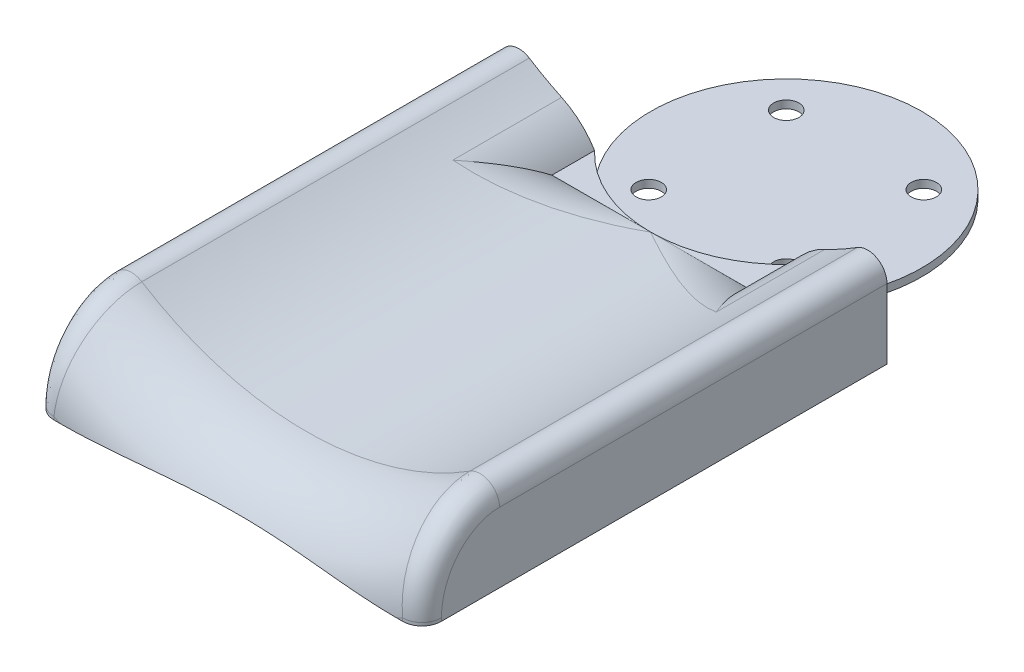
ISO-10303-21;
HEADER;
FILE_DESCRIPTION(('STEP AP214'),'2;1');
FILE_NAME('part.step','',(''),(''),'','','');
FILE_SCHEMA(('AUTOMOTIVE_DESIGN { 1 0 10303 214 1 1 1 1 }'));
ENDSEC;
DATA;
#1=APPLICATION_CONTEXT('core data for automotive mechanical design processes');
#2=APPLICATION_PROTOCOL_DEFINITION('international standard','automotive_design',2000,#1);
#3=PRODUCT_CONTEXT('',#1,'mechanical');
#4=PRODUCT('Part','Part','',(#3));
#5=PRODUCT_RELATED_PRODUCT_CATEGORY('part','',(#4));
#6=PRODUCT_DEFINITION_FORMATION('','',#4);
#7=PRODUCT_DEFINITION_CONTEXT('part definition',#1,'design');
#8=PRODUCT_DEFINITION('design','',#6,#7);
#9=PRODUCT_DEFINITION_SHAPE('','',#8);
#10=(LENGTH_UNIT() NAMED_UNIT(*) SI_UNIT(.MILLI.,.METRE.));
#11=(NAMED_UNIT(*) PLANE_ANGLE_UNIT() SI_UNIT($,.RADIAN.));
#12=(NAMED_UNIT(*) SI_UNIT($,.STERADIAN.) SOLID_ANGLE_UNIT());
#13=UNCERTAINTY_MEASURE_WITH_UNIT(LENGTH_MEASURE(1.E-05),#10,'distance_accuracy_value','');
#14=(GEOMETRIC_REPRESENTATION_CONTEXT(3) GLOBAL_UNCERTAINTY_ASSIGNED_CONTEXT((#13)) GLOBAL_UNIT_ASSIGNED_CONTEXT((#10,
#11,#12)) REPRESENTATION_CONTEXT('',''));
#15=CARTESIAN_POINT('',(0.,0.,0.));
#16=DIRECTION('',(0.,0.,1.));
#17=DIRECTION('',(1.,0.,0.));
#18=AXIS2_PLACEMENT_3D('',#15,#16,#17);
#19=CARTESIAN_POINT('',(0.,0.,144.));
#20=DIRECTION('',(0.,0.,1.));
#21=DIRECTION('',(1.,0.,0.));
#22=AXIS2_PLACEMENT_3D('',#19,#20,#21);
#23=PLANE('',#22);
#24=DIRECTION('',(1.,0.,0.));
#25=VECTOR('',#24,1.);
#26=CARTESIAN_POINT('',(-50.,0.,144.));
#27=LINE('',#26,#25);
#28=CARTESIAN_POINT('',(43.4330354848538,0.,144.));
#29=VERTEX_POINT('',#28);
#30=CARTESIAN_POINT('',(45.,0.,144.));
#31=VERTEX_POINT('',#30);
#32=EDGE_CURVE('E203',#29,#31,#27,.T.);
#33=ORIENTED_EDGE('',*,*,#32,.T.);
#34=DIRECTION('',(0.,1.,0.));
#35=VECTOR('',#34,1.);
#36=CARTESIAN_POINT('',(45.,3.50332923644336,144.));
#37=LINE('',#36,#35);
#38=CARTESIAN_POINT('',(45.0000000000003,0.779087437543,144.));
#39=VERTEX_POINT('',#38);
#40=EDGE_CURVE('E470',#31,#39,#37,.T.);
#41=ORIENTED_EDGE('',*,*,#40,.T.);
#42=CARTESIAN_POINT('',(0.,89.3214285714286,144.));
#43=DIRECTION('',(0.,0.,1.));
#44=DIRECTION('',(1.,0.,0.));
#45=AXIS2_PLACEMENT_3D('',#42,#43,#44);
#46=CIRCLE('',#45,99.3214285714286);
#47=EDGE_CURVE('E396',#39,#29,#46,.F.);
#48=ORIENTED_EDGE('',*,*,#47,.T.);
#49=EDGE_LOOP('',(#33,#41,#48));
#50=FACE_BOUND('',#49,.T.);
#51=ADVANCED_FACE('F34',(#50),#23,.T.);
#52=CARTESIAN_POINT('',(0.,1.99999999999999,0.));
#53=DIRECTION('',(0.,1.,0.));
#54=DIRECTION('',(-1.,0.,0.));
#55=AXIS2_PLACEMENT_3D('',#52,#53,#54);
#56=CYLINDRICAL_SURFACE('',#55,35.);
#57=CARTESIAN_POINT('',(0.,9.99999999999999,0.));
#58=DIRECTION('',(0.,1.,0.));
#59=DIRECTION('',(-1.,0.,0.));
#60=AXIS2_PLACEMENT_3D('',#57,#58,#59);
#61=CIRCLE('',#60,35.);
#62=CARTESIAN_POINT('',(25.475478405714,10.,24.));
#63=VERTEX_POINT('',#62);
#64=CARTESIAN_POINT('',(0.,10.,35.));
#65=VERTEX_POINT('',#64);
#66=EDGE_CURVE('E164',#63,#65,#61,.F.);
#67=ORIENTED_EDGE('',*,*,#66,.F.);
#68=DIRECTION('',(0.,1.,0.));
#69=VECTOR('',#68,1.);
#70=CARTESIAN_POINT('',(25.475478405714,2.,24.));
#71=LINE('',#70,#69);
#72=CARTESIAN_POINT('',(25.475478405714,2.,24.));
#73=VERTEX_POINT('',#72);
#74=EDGE_CURVE('E190',#73,#63,#71,.T.);
#75=ORIENTED_EDGE('',*,*,#74,.F.);
#76=CARTESIAN_POINT('',(0.,1.99999999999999,0.));
#77=DIRECTION('',(0.,1.,0.));
#78=DIRECTION('',(-1.,0.,0.));
#79=AXIS2_PLACEMENT_3D('',#76,#77,#78);
#80=CIRCLE('',#79,35.);
#81=CARTESIAN_POINT('',(-25.475478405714,1.99999999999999,24.));
#82=VERTEX_POINT('',#81);
#83=EDGE_CURVE('E185',#82,#73,#80,.T.);
#84=ORIENTED_EDGE('',*,*,#83,.F.);
#85=DIRECTION('',(0.,1.,0.));
#86=VECTOR('',#85,1.);
#87=CARTESIAN_POINT('',(-25.475478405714,1.99999999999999,24.));
#88=LINE('',#87,#86);
#89=CARTESIAN_POINT('',(-25.475478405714,9.99999999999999,24.));
#90=VERTEX_POINT('',#89);
#91=EDGE_CURVE('E191',#82,#90,#88,.T.);
#92=ORIENTED_EDGE('',*,*,#91,.T.);
#93=EDGE_CURVE('E249',#65,#90,#61,.F.);
#94=ORIENTED_EDGE('',*,*,#93,.F.);
#95=EDGE_LOOP('',(#67,#75,#84,#92,#94));
#96=FACE_BOUND('',#95,.T.);
#97=ADVANCED_FACE('F365',(#96),#56,.F.);
#98=CARTESIAN_POINT('',(0.,0.,24.));
#99=DIRECTION('',(0.,0.,1.));
#100=DIRECTION('',(1.,0.,0.));
#101=AXIS2_PLACEMENT_3D('',#98,#99,#100);
#102=PLANE('',#101);
#103=CARTESIAN_POINT('',(0.,89.3214285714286,24.));
#104=DIRECTION('',(0.,0.,1.));
#105=DIRECTION('',(1.,0.,0.));
#106=AXIS2_PLACEMENT_3D('',#103,#104,#105);
#107=CIRCLE('',#106,79.3214285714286);
#108=CARTESIAN_POINT('',(42.3316391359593,22.2399754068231,24.));
#109=VERTEX_POINT('',#108);
#110=CARTESIAN_POINT('',(33.9752981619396,17.6445972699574,24.));
#111=VERTEX_POINT('',#110);
#112=EDGE_CURVE('E197',#109,#111,#107,.F.);
#113=ORIENTED_EDGE('',*,*,#112,.F.);
#114=CARTESIAN_POINT('',(45.,18.0115182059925,24.));
#115=DIRECTION('',(0.,0.,1.));
#116=DIRECTION('',(1.,0.,0.));
#117=AXIS2_PLACEMENT_3D('',#114,#115,#116);
#118=CIRCLE('',#117,5.);
#119=CARTESIAN_POINT('',(50.,18.0115182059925,24.));
#120=VERTEX_POINT('',#119);
#121=EDGE_CURVE('E47',#109,#120,#118,.F.);
#122=ORIENTED_EDGE('',*,*,#121,.T.);
#123=DIRECTION('',(0.,1.,0.));
#124=VECTOR('',#123,1.);
#125=CARTESIAN_POINT('',(50.,0.,24.));
#126=LINE('',#125,#124);
#127=CARTESIAN_POINT('',(50.,0.,24.));
#128=VERTEX_POINT('',#127);
#129=EDGE_CURVE('E208',#128,#120,#126,.T.);
#130=ORIENTED_EDGE('',*,*,#129,.F.);
#131=DIRECTION('',(1.,0.,0.));
#132=VECTOR('',#131,1.);
#133=CARTESIAN_POINT('',(-50.,0.,24.));
#134=LINE('',#133,#132);
#135=CARTESIAN_POINT('',(25.475478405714,0.,24.));
#136=VERTEX_POINT('',#135);
#137=EDGE_CURVE('E205',#136,#128,#134,.T.);
#138=ORIENTED_EDGE('',*,*,#137,.F.);
#139=DIRECTION('',(0.,1.,0.));
#140=VECTOR('',#139,1.);
#141=CARTESIAN_POINT('',(25.475478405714,-8.,24.));
#142=LINE('',#141,#140);
#143=EDGE_CURVE('E237',#136,#73,#142,.T.);
#144=ORIENTED_EDGE('',*,*,#143,.T.);
#145=ORIENTED_EDGE('',*,*,#74,.T.);
#146=CARTESIAN_POINT('',(42.5417848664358,-0.427904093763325,24.));
#147=DIRECTION('',(0.,0.,1.));
#148=DIRECTION('',(1.,0.,0.));
#149=AXIS2_PLACEMENT_3D('',#146,#147,#148);
#150=CIRCLE('',#149,20.);
#151=EDGE_CURVE('E181',#63,#111,#150,.F.);
#152=ORIENTED_EDGE('',*,*,#151,.T.);
#153=EDGE_LOOP('',(#113,#122,#130,#138,#144,#145,#152));
#154=FACE_BOUND('',#153,.T.);
#155=ADVANCED_FACE('F373',(#154),#102,.F.);
#156=DIRECTION('',(0.,-1.,0.));
#157=VECTOR('',#156,1.);
#158=CARTESIAN_POINT('',(-50.,24.,24.));
#159=LINE('',#158,#157);
#160=CARTESIAN_POINT('',(-50.,18.0115182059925,24.));
#161=VERTEX_POINT('',#160);
#162=CARTESIAN_POINT('',(-50.,0.,24.));
#163=VERTEX_POINT('',#162);
#164=EDGE_CURVE('E199',#161,#163,#159,.T.);
#165=ORIENTED_EDGE('',*,*,#164,.F.);
#166=CARTESIAN_POINT('',(-45.,18.0115182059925,24.));
#167=DIRECTION('',(0.,0.,1.));
#168=DIRECTION('',(1.,0.,0.));
#169=AXIS2_PLACEMENT_3D('',#166,#167,#168);
#170=CIRCLE('',#169,5.);
#171=CARTESIAN_POINT('',(-42.3316391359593,22.2399754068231,24.));
#172=VERTEX_POINT('',#171);
#173=EDGE_CURVE('E11',#161,#172,#170,.F.);
#174=ORIENTED_EDGE('',*,*,#173,.T.);
#175=CARTESIAN_POINT('',(-33.9752981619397,17.6445972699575,24.));
#176=VERTEX_POINT('',#175);
#177=EDGE_CURVE('E194',#176,#172,#107,.F.);
#178=ORIENTED_EDGE('',*,*,#177,.F.);
#179=CARTESIAN_POINT('',(-42.541784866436,-0.42790409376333,24.));
#180=DIRECTION('',(0.,0.,1.));
#181=DIRECTION('',(1.,0.,0.));
#182=AXIS2_PLACEMENT_3D('',#179,#180,#181);
#183=CIRCLE('',#182,20.);
#184=EDGE_CURVE('E397',#176,#90,#183,.F.);
#185=ORIENTED_EDGE('',*,*,#184,.T.);
#186=ORIENTED_EDGE('',*,*,#91,.F.);
#187=DIRECTION('',(0.,1.,0.));
#188=VECTOR('',#187,1.);
#189=CARTESIAN_POINT('',(-25.475478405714,-8.,24.));
#190=LINE('',#189,#188);
#191=CARTESIAN_POINT('',(-25.475478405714,0.,24.));
#192=VERTEX_POINT('',#191);
#193=EDGE_CURVE('E240',#192,#82,#190,.T.);
#194=ORIENTED_EDGE('',*,*,#193,.F.);
#195=EDGE_CURVE('E206',#163,#192,#134,.T.);
#196=ORIENTED_EDGE('',*,*,#195,.F.);
#197=EDGE_LOOP('',(#165,#174,#178,#185,#186,#194,#196));
#198=FACE_BOUND('',#197,.T.);
#199=ADVANCED_FACE('F378',(#198),#102,.F.);
#200=CARTESIAN_POINT('',(0.,89.3214285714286,144.));
#201=DIRECTION('',(0.,0.,1.));
#202=DIRECTION('',(1.,0.,0.));
#203=AXIS2_PLACEMENT_3D('',#200,#201,#202);
#204=CIRCLE('',#203,99.3214285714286);
#205=CARTESIAN_POINT('',(-43.4330354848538,0.,144.));
#206=VERTEX_POINT('',#205);
#207=CARTESIAN_POINT('',(-45.,0.779087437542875,144.));
#208=VERTEX_POINT('',#207);
#209=EDGE_CURVE('E300',#206,#208,#204,.F.);
#210=ORIENTED_EDGE('',*,*,#209,.T.);
#211=DIRECTION('',(0.,-1.,0.));
#212=VECTOR('',#211,1.);
#213=CARTESIAN_POINT('',(-45.,0.,144.));
#214=LINE('',#213,#212);
#215=CARTESIAN_POINT('',(-45.,0.,144.));
#216=VERTEX_POINT('',#215);
#217=EDGE_CURVE('E392',#208,#216,#214,.T.);
#218=ORIENTED_EDGE('',*,*,#217,.T.);
#219=EDGE_CURVE('E200',#216,#206,#27,.T.);
#220=ORIENTED_EDGE('',*,*,#219,.T.);
#221=EDGE_LOOP('',(#210,#218,#220));
#222=FACE_BOUND('',#221,.T.);
#223=ADVANCED_FACE('F367',(#222),#23,.T.);
#224=CARTESIAN_POINT('',(0.,2.,0.));
#225=DIRECTION('',(0.,-1.,0.));
#226=DIRECTION('',(0.,0.,-1.));
#227=AXIS2_PLACEMENT_3D('',#224,#225,#226);
#228=CYLINDRICAL_SURFACE('',#227,35.);
#229=CARTESIAN_POINT('',(0.,2.,0.));
#230=DIRECTION('',(0.,1.,0.));
#231=DIRECTION('',(0.,0.,1.));
#232=AXIS2_PLACEMENT_3D('',#229,#230,#231);
#233=CIRCLE('',#232,35.);
#234=EDGE_CURVE('E246',#73,#82,#233,.T.);
#235=ORIENTED_EDGE('',*,*,#234,.F.);
#236=ORIENTED_EDGE('',*,*,#143,.F.);
#237=CARTESIAN_POINT('',(0.,0.,0.));
#238=DIRECTION('',(0.,1.,0.));
#239=DIRECTION('',(0.,0.,1.));
#240=AXIS2_PLACEMENT_3D('',#237,#238,#239);
#241=CIRCLE('',#240,35.);
#242=EDGE_CURVE('E243',#136,#192,#241,.T.);
#243=ORIENTED_EDGE('',*,*,#242,.T.);
#244=ORIENTED_EDGE('',*,*,#193,.T.);
#245=EDGE_LOOP('',(#235,#236,#243,#244));
#246=FACE_BOUND('',#245,.T.);
#247=ADVANCED_FACE('F272',(#246),#228,.T.);
#248=CARTESIAN_POINT('',(0.,2.,0.));
#249=DIRECTION('',(0.,1.,0.));
#250=DIRECTION('',(0.,0.,1.));
#251=AXIS2_PLACEMENT_3D('',#248,#249,#250);
#252=PLANE('',#251);
#253=CARTESIAN_POINT('',(-17.75,2.,17.75));
#254=DIRECTION('',(0.,1.,0.));
#255=DIRECTION('',(0.,0.,1.));
#256=AXIS2_PLACEMENT_3D('',#253,#254,#255);
#257=CIRCLE('',#256,3.25);
#258=CARTESIAN_POINT('',(-17.75,2.,21.));
#259=VERTEX_POINT('',#258);
#260=EDGE_CURVE('E215',#259,#259,#257,.T.);
#261=ORIENTED_EDGE('',*,*,#260,.F.);
#262=EDGE_LOOP('',(#261));
#263=FACE_BOUND('',#262,.T.);
#264=CARTESIAN_POINT('',(17.75,2.,17.75));
#265=DIRECTION('',(0.,1.,0.));
#266=DIRECTION('',(0.,0.,1.));
#267=AXIS2_PLACEMENT_3D('',#264,#265,#266);
#268=CIRCLE('',#267,3.25);
#269=CARTESIAN_POINT('',(17.75,2.,21.));
#270=VERTEX_POINT('',#269);
#271=EDGE_CURVE('E219',#270,#270,#268,.T.);
#272=ORIENTED_EDGE('',*,*,#271,.F.);
#273=EDGE_LOOP('',(#272));
#274=FACE_BOUND('',#273,.T.);
#275=CARTESIAN_POINT('',(17.75,2.,-17.75));
#276=DIRECTION('',(0.,1.,0.));
#277=DIRECTION('',(0.,0.,1.));
#278=AXIS2_PLACEMENT_3D('',#275,#276,#277);
#279=CIRCLE('',#278,3.25);
#280=CARTESIAN_POINT('',(17.75,2.,-14.5));
#281=VERTEX_POINT('',#280);
#282=EDGE_CURVE('E225',#281,#281,#279,.T.);
#283=ORIENTED_EDGE('',*,*,#282,.F.);
#284=EDGE_LOOP('',(#283));
#285=FACE_BOUND('',#284,.T.);
#286=CARTESIAN_POINT('',(-17.75,2.,-17.75));
#287=DIRECTION('',(0.,1.,0.));
#288=DIRECTION('',(0.,0.,1.));
#289=AXIS2_PLACEMENT_3D('',#286,#287,#288);
#290=CIRCLE('',#289,3.25);
#291=CARTESIAN_POINT('',(-17.75,2.,-14.5));
#292=VERTEX_POINT('',#291);
#293=EDGE_CURVE('E231',#292,#292,#290,.T.);
#294=ORIENTED_EDGE('',*,*,#293,.F.);
#295=EDGE_LOOP('',(#294));
#296=FACE_BOUND('',#295,.T.);
#297=ORIENTED_EDGE('',*,*,#234,.T.);
#298=ORIENTED_EDGE('',*,*,#83,.T.);
#299=EDGE_LOOP('',(#297,#298));
#300=FACE_BOUND('',#299,.T.);
#301=ADVANCED_FACE('F385',(#263,#274,#285,#296,#300),#252,.T.);
#302=CARTESIAN_POINT('',(0.,0.,0.));
#303=DIRECTION('',(0.,1.,0.));
#304=DIRECTION('',(0.,0.,1.));
#305=AXIS2_PLACEMENT_3D('',#302,#303,#304);
#306=PLANE('',#305);
#307=CARTESIAN_POINT('',(-17.75,0.,17.75));
#308=DIRECTION('',(0.,1.,0.));
#309=DIRECTION('',(0.,0.,1.));
#310=AXIS2_PLACEMENT_3D('',#307,#308,#309);
#311=CIRCLE('',#310,3.25);
#312=CARTESIAN_POINT('',(-17.75,0.,21.));
#313=VERTEX_POINT('',#312);
#314=EDGE_CURVE('E216',#313,#313,#311,.T.);
#315=ORIENTED_EDGE('',*,*,#314,.T.);
#316=EDGE_LOOP('',(#315));
#317=FACE_BOUND('',#316,.T.);
#318=CARTESIAN_POINT('',(17.75,0.,17.75));
#319=DIRECTION('',(0.,1.,0.));
#320=DIRECTION('',(0.,0.,1.));
#321=AXIS2_PLACEMENT_3D('',#318,#319,#320);
#322=CIRCLE('',#321,3.25);
#323=CARTESIAN_POINT('',(17.75,0.,21.));
#324=VERTEX_POINT('',#323);
#325=EDGE_CURVE('E222',#324,#324,#322,.T.);
#326=ORIENTED_EDGE('',*,*,#325,.T.);
#327=EDGE_LOOP('',(#326));
#328=FACE_BOUND('',#327,.T.);
#329=CARTESIAN_POINT('',(17.75,0.,-17.75));
#330=DIRECTION('',(0.,1.,0.));
#331=DIRECTION('',(0.,0.,1.));
#332=AXIS2_PLACEMENT_3D('',#329,#330,#331);
#333=CIRCLE('',#332,3.25);
#334=CARTESIAN_POINT('',(17.75,0.,-14.5));
#335=VERTEX_POINT('',#334);
#336=EDGE_CURVE('E228',#335,#335,#333,.T.);
#337=ORIENTED_EDGE('',*,*,#336,.T.);
#338=EDGE_LOOP('',(#337));
#339=FACE_BOUND('',#338,.T.);
#340=CARTESIAN_POINT('',(-17.75,0.,-17.75));
#341=DIRECTION('',(0.,1.,0.));
#342=DIRECTION('',(0.,0.,1.));
#343=AXIS2_PLACEMENT_3D('',#340,#341,#342);
#344=CIRCLE('',#343,3.25);
#345=CARTESIAN_POINT('',(-17.75,0.,-14.5));
#346=VERTEX_POINT('',#345);
#347=EDGE_CURVE('E234',#346,#346,#344,.T.);
#348=ORIENTED_EDGE('',*,*,#347,.T.);
#349=EDGE_LOOP('',(#348));
#350=FACE_BOUND('',#349,.T.);
#351=DIRECTION('',(0.,0.,-1.));
#352=VECTOR('',#351,1.);
#353=CARTESIAN_POINT('',(50.,0.,144.));
#354=LINE('',#353,#352);
#355=CARTESIAN_POINT('',(50.,0.,139.));
#356=VERTEX_POINT('',#355);
#357=EDGE_CURVE('E202',#356,#128,#354,.T.);
#358=ORIENTED_EDGE('',*,*,#357,.F.);
#359=CARTESIAN_POINT('',(45.,0.,139.));
#360=DIRECTION('',(0.,1.,0.));
#361=DIRECTION('',(0.,0.,1.));
#362=AXIS2_PLACEMENT_3D('',#359,#360,#361);
#363=CIRCLE('',#362,5.);
#364=EDGE_CURVE('E412',#356,#31,#363,.F.);
#365=ORIENTED_EDGE('',*,*,#364,.T.);
#366=ORIENTED_EDGE('',*,*,#32,.F.);
#367=CARTESIAN_POINT('',(43.4330354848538,0.,144.));
#368=CARTESIAN_POINT('',(42.5955665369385,0.,143.999979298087));
#369=CARTESIAN_POINT('',(41.7581600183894,0.,143.98994191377));
#370=CARTESIAN_POINT('',(40.0838489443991,0.,143.952500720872));
#371=CARTESIAN_POINT('',(39.2469443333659,0.,143.925099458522));
#372=CARTESIAN_POINT('',(37.5743629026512,0.,143.85562057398));
#373=CARTESIAN_POINT('',(36.7386856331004,0.,143.813553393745));
#374=CARTESIAN_POINT('',(35.0680080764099,0.,143.717270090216));
#375=CARTESIAN_POINT('',(34.2330078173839,0.,143.663053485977));
#376=CARTESIAN_POINT('',(31.7258605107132,0.,143.485679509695));
#377=CARTESIAN_POINT('',(30.0547599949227,0.,143.347949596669));
#378=CARTESIAN_POINT('',(26.7140567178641,0.,143.052940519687));
#379=CARTESIAN_POINT('',(25.0444543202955,0.,142.89565747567));
#380=CARTESIAN_POINT('',(21.7143748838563,0.,142.58107755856));
#381=CARTESIAN_POINT('',(20.0538974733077,0.,142.423785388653));
#382=CARTESIAN_POINT('',(17.5620922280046,0.,142.200308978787));
#383=CARTESIAN_POINT('',(16.7313318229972,0.,142.127895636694));
#384=CARTESIAN_POINT('',(15.0692982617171,0.,141.989248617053));
#385=CARTESIAN_POINT('',(14.2380251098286,0.,141.923014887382));
#386=CARTESIAN_POINT('',(12.576496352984,0.,141.798750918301));
#387=CARTESIAN_POINT('',(11.7462419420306,0.,141.740704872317));
#388=CARTESIAN_POINT('',(10.0851053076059,0.,141.634352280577));
#389=CARTESIAN_POINT('',(9.25422308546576,0.,141.586045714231));
#390=CARTESIAN_POINT('',(7.5918802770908,0.,141.500610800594));
#391=CARTESIAN_POINT('',(6.76041969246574,0.,141.463482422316));
#392=CARTESIAN_POINT('',(5.09703388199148,0.,141.401528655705));
#393=CARTESIAN_POINT('',(4.26510865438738,0.,141.376703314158));
#394=CARTESIAN_POINT('',(2.45868208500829,0.,141.337003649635));
#395=CARTESIAN_POINT('',(1.48412582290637,0.,141.324556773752));
#396=CARTESIAN_POINT('',(-0.465049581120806,0.,141.318137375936));
#397=CARTESIAN_POINT('',(-1.43966872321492,0.,141.324164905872));
#398=CARTESIAN_POINT('',(-3.3886175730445,0.,141.354433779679));
#399=CARTESIAN_POINT('',(-4.36294728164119,0.,141.378675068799));
#400=CARTESIAN_POINT('',(-6.31102028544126,0.,141.444343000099));
#401=CARTESIAN_POINT('',(-7.28476357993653,0.,141.48576966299));
#402=CARTESIAN_POINT('',(-9.23378933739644,0.,141.584197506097));
#403=CARTESIAN_POINT('',(-10.2090699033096,0.,141.641235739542));
#404=CARTESIAN_POINT('',(-12.1587600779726,0.,141.768506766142));
#405=CARTESIAN_POINT('',(-13.1331696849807,0.,141.838739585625));
#406=CARTESIAN_POINT('',(-15.0812881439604,0.,141.989605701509));
#407=CARTESIAN_POINT('',(-16.0549968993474,0.,142.070240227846));
#408=CARTESIAN_POINT('',(-18.0017838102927,0.,142.238748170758));
#409=CARTESIAN_POINT('',(-18.9748619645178,0.,142.32662160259));
#410=CARTESIAN_POINT('',(-21.9050449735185,0.,142.597117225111));
#411=CARTESIAN_POINT('',(-23.861585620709,0.,142.785644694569));
#412=CARTESIAN_POINT('',(-27.7754992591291,0.,143.149106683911));
#413=CARTESIAN_POINT('',(-29.7328718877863,0.,143.324044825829));
#414=CARTESIAN_POINT('',(-32.6682049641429,0.,143.553047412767));
#415=CARTESIAN_POINT('',(-33.6448344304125,0.,143.623720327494));
#416=CARTESIAN_POINT('',(-35.599013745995,0.,143.750170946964));
#417=CARTESIAN_POINT('',(-36.5765635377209,0.,143.805949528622));
#418=CARTESIAN_POINT('',(-38.5335158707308,0.,143.898654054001));
#419=CARTESIAN_POINT('',(-39.5129192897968,0.,143.935562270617));
#420=CARTESIAN_POINT('',(-41.4725223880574,0.,143.986219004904));
#421=CARTESIAN_POINT('',(-42.4527221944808,0.,143.999962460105));
#422=CARTESIAN_POINT('',(-43.4330354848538,0.,144.));
#423=B_SPLINE_CURVE_WITH_KNOTS('',3,(#367,#368,#369,#370,#371,#372,#373,#374,#375,#376,#377,
#378,#379,#380,#381,#382,#383,#384,#385,#386,#387,#388,#389,#390,#391,#392,#393,#394,#395,#396,
#397,#398,#399,#400,#401,#402,#403,#404,#405,#406,#407,#408,#409,#410,#411,#412,#413,#414,#415,
#416,#417,#418,#419,#420,#421,#422),.UNSPECIFIED.,.F.,.F.,(4,2,2,2,2,2,2,2,2,2,2,2,2,2,2,2,2,2,
2,2,2,2,2,2,2,2,2,4),(0.,2.51225722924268,5.02414614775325,7.53425027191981,10.0444537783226,
15.0744479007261,20.1054417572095,25.109144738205,27.6108586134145,30.1125513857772,
32.6093464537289,35.1061362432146,37.6029191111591,40.0997114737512,43.023442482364,
45.9471816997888,48.8709121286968,51.7946460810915,54.7253804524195,57.6561206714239,
60.5872077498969,63.5183010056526,69.415146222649,75.3104142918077,78.2478723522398,
81.1851574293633,84.1251967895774,87.0658785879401),.UNSPECIFIED.);
#424=EDGE_CURVE('E317',#29,#206,#423,.T.);
#425=ORIENTED_EDGE('',*,*,#424,.T.);
#426=ORIENTED_EDGE('',*,*,#219,.F.);
#427=CARTESIAN_POINT('',(-45.,0.,139.));
#428=DIRECTION('',(0.,1.,0.));
#429=DIRECTION('',(0.,0.,1.));
#430=AXIS2_PLACEMENT_3D('',#427,#428,#429);
#431=CIRCLE('',#430,5.);
#432=CARTESIAN_POINT('',(-50.,0.,139.));
#433=VERTEX_POINT('',#432);
#434=EDGE_CURVE('E410',#216,#433,#431,.F.);
#435=ORIENTED_EDGE('',*,*,#434,.T.);
#436=DIRECTION('',(0.,0.,-1.));
#437=VECTOR('',#436,1.);
#438=CARTESIAN_POINT('',(-50.,0.,144.));
#439=LINE('',#438,#437);
#440=EDGE_CURVE('E212',#433,#163,#439,.T.);
#441=ORIENTED_EDGE('',*,*,#440,.T.);
#442=ORIENTED_EDGE('',*,*,#195,.T.);
#443=ORIENTED_EDGE('',*,*,#242,.F.);
#444=ORIENTED_EDGE('',*,*,#137,.T.);
#445=EDGE_LOOP('',(#358,#365,#366,#425,#426,#435,#441,#442,#443,#444));
#446=FACE_BOUND('',#445,.T.);
#447=ADVANCED_FACE('F443',(#317,#328,#339,#350,#446),#306,.F.);
#448=CARTESIAN_POINT('',(-17.75,0.,-17.75));
#449=DIRECTION('',(0.,1.,0.));
#450=DIRECTION('',(0.,0.,1.));
#451=AXIS2_PLACEMENT_3D('',#448,#449,#450);
#452=CYLINDRICAL_SURFACE('',#451,3.25);
#453=ORIENTED_EDGE('',*,*,#347,.F.);
#454=EDGE_LOOP('',(#453));
#455=FACE_BOUND('',#454,.T.);
#456=ORIENTED_EDGE('',*,*,#293,.T.);
#457=EDGE_LOOP('',(#456));
#458=FACE_BOUND('',#457,.T.);
#459=ADVANCED_FACE('F439',(#455,#458),#452,.F.);
#460=CARTESIAN_POINT('',(17.75,0.,-17.75));
#461=DIRECTION('',(0.,1.,0.));
#462=DIRECTION('',(0.,0.,1.));
#463=AXIS2_PLACEMENT_3D('',#460,#461,#462);
#464=CYLINDRICAL_SURFACE('',#463,3.25);
#465=ORIENTED_EDGE('',*,*,#336,.F.);
#466=EDGE_LOOP('',(#465));
#467=FACE_BOUND('',#466,.T.);
#468=ORIENTED_EDGE('',*,*,#282,.T.);
#469=EDGE_LOOP('',(#468));
#470=FACE_BOUND('',#469,.T.);
#471=ADVANCED_FACE('F435',(#467,#470),#464,.F.);
#472=CARTESIAN_POINT('',(17.75,0.,17.75));
#473=DIRECTION('',(0.,1.,0.));
#474=DIRECTION('',(0.,0.,1.));
#475=AXIS2_PLACEMENT_3D('',#472,#473,#474);
#476=CYLINDRICAL_SURFACE('',#475,3.25);
#477=ORIENTED_EDGE('',*,*,#325,.F.);
#478=EDGE_LOOP('',(#477));
#479=FACE_BOUND('',#478,.T.);
#480=ORIENTED_EDGE('',*,*,#271,.T.);
#481=EDGE_LOOP('',(#480));
#482=FACE_BOUND('',#481,.T.);
#483=ADVANCED_FACE('F431',(#479,#482),#476,.F.);
#484=CARTESIAN_POINT('',(-17.75,0.,17.75));
#485=DIRECTION('',(0.,1.,0.));
#486=DIRECTION('',(0.,0.,1.));
#487=AXIS2_PLACEMENT_3D('',#484,#485,#486);
#488=CYLINDRICAL_SURFACE('',#487,3.25);
#489=ORIENTED_EDGE('',*,*,#314,.F.);
#490=EDGE_LOOP('',(#489));
#491=FACE_BOUND('',#490,.T.);
#492=ORIENTED_EDGE('',*,*,#260,.T.);
#493=EDGE_LOOP('',(#492));
#494=FACE_BOUND('',#493,.T.);
#495=ADVANCED_FACE('F425',(#491,#494),#488,.F.);
#496=CARTESIAN_POINT('',(-50.,24.,144.));
#497=DIRECTION('',(1.,0.,0.));
#498=DIRECTION('',(0.,0.,-1.));
#499=AXIS2_PLACEMENT_3D('',#496,#497,#498);
#500=PLANE('',#499);
#501=ORIENTED_EDGE('',*,*,#440,.F.);
#502=DIRECTION('',(0.,-1.,0.));
#503=VECTOR('',#502,1.);
#504=CARTESIAN_POINT('',(-50.,3.50332923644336,139.));
#505=LINE('',#504,#503);
#506=CARTESIAN_POINT('',(-50.,0.77908743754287,139.));
#507=VERTEX_POINT('',#506);
#508=EDGE_CURVE('E344',#433,#507,#505,.F.);
#509=ORIENTED_EDGE('',*,*,#508,.T.);
#510=CARTESIAN_POINT('',(-45.8181137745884,-7.32911408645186,142.483478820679));
#511=CARTESIAN_POINT('',(-47.6276561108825,-7.22410936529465,142.202319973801));
#512=CARTESIAN_POINT('',(-48.8138280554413,-6.7346053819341,140.891632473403));
#513=CARTESIAN_POINT('',(-50.,-6.24510139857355,139.580944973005));
#514=CARTESIAN_POINT('',(-50.,-5.60335250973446,137.862609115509));
#515=CARTESIAN_POINT('',(-45.7637728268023,-6.76086889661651,142.705358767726));
#516=CARTESIAN_POINT('',(-47.5919990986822,-6.66903886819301,142.437857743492));
#517=CARTESIAN_POINT('',(-48.7960174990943,-6.21392808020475,141.108540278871));
#518=CARTESIAN_POINT('',(-50.,-5.75774983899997,139.77968248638));
#519=CARTESIAN_POINT('',(-50.,-5.15784862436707,138.029019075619));
#520=CARTESIAN_POINT('',(-45.7080440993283,-6.18445640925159,142.902873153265));
#521=CARTESIAN_POINT('',(-47.5552139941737,-6.10534533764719,142.650496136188));
#522=CARTESIAN_POINT('',(-48.7776274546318,-5.68468511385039,141.304365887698));
#523=CARTESIAN_POINT('',(-50.,-5.26286236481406,139.958618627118));
#524=CARTESIAN_POINT('',(-50.,-4.70558861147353,138.177154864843));
#525=CARTESIAN_POINT('',(-45.5940785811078,-5.01921611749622,143.24918971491));
#526=CARTESIAN_POINT('',(-47.4794123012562,-4.96322817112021,143.030407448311));
#527=CARTESIAN_POINT('',(-48.7397266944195,-4.6123095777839,141.653679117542));
#528=CARTESIAN_POINT('',(-50.,-4.26023331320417,140.277323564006));
#529=CARTESIAN_POINT('',(-50.,-3.79055133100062,138.436892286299));
#530=CARTESIAN_POINT('',(-45.5358411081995,-4.4303849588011,143.39797854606));
#531=CARTESIAN_POINT('',(-47.440385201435,-4.38469231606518,143.197594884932));
#532=CARTESIAN_POINT('',(-48.7202156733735,-4.06917324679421,141.807155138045));
#533=CARTESIAN_POINT('',(-50.,-3.75239341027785,140.417017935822));
#534=CARTESIAN_POINT('',(-50.,-3.32777121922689,138.548483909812));
#535=CARTESIAN_POINT('',(-45.4176337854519,-3.24931938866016,143.645739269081));
#536=CARTESIAN_POINT('',(-47.3605196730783,-3.22136486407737,143.485086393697));
#537=CARTESIAN_POINT('',(-48.6802825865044,-2.9769593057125,142.070411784));
#538=CARTESIAN_POINT('',(-50.,-2.73130792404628,140.656038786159));
#539=CARTESIAN_POINT('',(-50.,-2.39869402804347,138.734304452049));
#540=CARTESIAN_POINT('',(-45.3576816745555,-2.65715062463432,143.745102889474));
#541=CARTESIAN_POINT('',(-47.3196876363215,-2.63655039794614,143.605675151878));
#542=CARTESIAN_POINT('',(-48.6598691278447,-2.42796482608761,142.180534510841));
#543=CARTESIAN_POINT('',(-50.,-2.21804177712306,140.755609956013));
#544=CARTESIAN_POINT('',(-50.,-1.93245532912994,138.808827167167));
#545=CARTESIAN_POINT('',(-45.2359099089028,-1.46869321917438,143.895993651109));
#546=CARTESIAN_POINT('',(-47.2360288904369,-1.45960356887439,143.801750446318));
#547=CARTESIAN_POINT('',(-48.6180397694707,-1.32305982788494,142.358750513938));
#548=CARTESIAN_POINT('',(-50.,-1.18517861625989,140.915965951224));
#549=CARTESIAN_POINT('',(-50.,-0.995842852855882,138.921995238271));
#550=CARTESIAN_POINT('',(-45.174091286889,-0.872406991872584,143.947546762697));
#551=CARTESIAN_POINT('',(-47.1931930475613,-0.867381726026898,143.877164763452));
#552=CARTESIAN_POINT('',(-48.5966244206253,-0.767153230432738,142.426866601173));
#553=CARTESIAN_POINT('',(-50.,-0.665503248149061,140.976688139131));
#554=CARTESIAN_POINT('',(-50.,-0.525471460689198,138.960660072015));
#555=CARTESIAN_POINT('',(-45.0930501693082,-0.100117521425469,143.983604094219));
#556=CARTESIAN_POINT('',(-47.1365677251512,-0.0987021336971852,143.945576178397));
#557=CARTESIAN_POINT('',(-48.5682862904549,-0.0449377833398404,142.487899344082));
#558=CARTESIAN_POINT('',(-50.,0.00895045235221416,141.030233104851));
#559=CARTESIAN_POINT('',(-50.,0.0843482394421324,138.987703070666));
#560=CARTESIAN_POINT('',(-45.0745375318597,0.0756771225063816,143.989752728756));
#561=CARTESIAN_POINT('',(-47.123585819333,0.0765902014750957,143.959198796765));
#562=CARTESIAN_POINT('',(-48.5617954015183,0.119607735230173,142.499969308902));
#563=CARTESIAN_POINT('',(-50.,0.162750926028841,141.040747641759));
#564=CARTESIAN_POINT('',(-50.,0.223201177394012,138.992314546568));
#565=CARTESIAN_POINT('',(-45.0373709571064,0.427355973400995,143.997952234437));
#566=CARTESIAN_POINT('',(-47.0974509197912,0.427594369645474,143.98253871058));
#567=CARTESIAN_POINT('',(-48.5487279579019,0.449089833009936,142.520479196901));
#568=CARTESIAN_POINT('',(-50.,0.470711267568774,141.058427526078));
#569=CARTESIAN_POINT('',(-50.,0.501060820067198,138.998464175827));
#570=CARTESIAN_POINT('',(-45.0187169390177,0.603240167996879,144.000000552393));
#571=CARTESIAN_POINT('',(-47.0842975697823,0.603308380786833,143.992250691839));
#572=CARTESIAN_POINT('',(-48.5421513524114,0.61402659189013,142.528916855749));
#573=CARTESIAN_POINT('',(-50.,0.624873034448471,141.065588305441));
#574=CARTESIAN_POINT('',(-50.,0.640067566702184,139.000000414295));
#575=CARTESIAN_POINT('',(-44.9283148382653,1.45257576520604,143.999997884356));
#576=CARTESIAN_POINT('',(-47.020303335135,1.45357686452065,144.02973520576));
#577=CARTESIAN_POINT('',(-48.5101893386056,1.41126417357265,142.560876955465));
#578=CARTESIAN_POINT('',(-50.,1.37083019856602,141.092093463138));
#579=CARTESIAN_POINT('',(-50.,1.31152823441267,138.999998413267));
#580=CARTESIAN_POINT('',(-44.8557067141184,2.12552245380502,143.969941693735));
#581=CARTESIAN_POINT('',(-46.968408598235,2.12909329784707,144.030574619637));
#582=CARTESIAN_POINT('',(-48.4842456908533,2.0452610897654,142.559514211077));
#583=CARTESIAN_POINT('',(-50.,1.96340875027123,141.088365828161));
#584=CARTESIAN_POINT('',(-50.,1.84416154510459,138.97745627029));
#585=CARTESIAN_POINT('',(-44.7091399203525,3.4653185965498,143.850401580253));
#586=CARTESIAN_POINT('',(-46.862438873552,3.47950082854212,143.974841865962));
#587=CARTESIAN_POINT('',(-48.4312610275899,3.31269518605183,142.503397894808));
#588=CARTESIAN_POINT('',(-50.,3.14787968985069,141.031866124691));
#589=CARTESIAN_POINT('',(-50.,2.90590134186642,138.887801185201));
#590=CARTESIAN_POINT('',(-44.6351803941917,4.13216375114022,143.760878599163));
#591=CARTESIAN_POINT('',(-46.8083482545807,4.1544830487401,143.918047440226));
#592=CARTESIAN_POINT('',(-48.4042193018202,3.94613172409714,142.448609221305));
#593=CARTESIAN_POINT('',(-50.,3.73985147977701,140.978903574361));
#594=CARTESIAN_POINT('',(-50.,3.43500527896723,138.820658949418));
#595=CARTESIAN_POINT('',(-44.4862847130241,5.4563426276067,143.522906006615));
#596=CARTESIAN_POINT('',(-46.6981095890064,5.50093970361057,143.74675307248));
#597=CARTESIAN_POINT('',(-48.3491002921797,5.20971456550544,142.285428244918));
#598=CARTESIAN_POINT('',(-50.,4.92057560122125,140.823833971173));
#599=CARTESIAN_POINT('',(-50.,4.48700980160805,138.642179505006));
#600=CARTESIAN_POINT('',(-44.4113466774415,6.11365043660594,143.374318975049));
#601=CARTESIAN_POINT('',(-46.6419437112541,6.17246985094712,143.63191692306));
#602=CARTESIAN_POINT('',(-48.3210207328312,5.83984969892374,142.176910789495));
#603=CARTESIAN_POINT('',(-50.,5.50937597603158,140.721440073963));
#604=CARTESIAN_POINT('',(-50.,5.00989297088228,138.530739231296));
#605=CARTESIAN_POINT('',(-44.2612586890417,7.41233869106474,143.019127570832));
#606=CARTESIAN_POINT('',(-46.5279822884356,7.50601883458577,143.344333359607));
#607=CARTESIAN_POINT('',(-48.2640401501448,7.09117885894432,141.90615657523));
#608=CARTESIAN_POINT('',(-50.,6.67849160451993,140.467514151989));
#609=CARTESIAN_POINT('',(-50.,6.04436045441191,138.264345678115));
#610=CARTESIAN_POINT('',(-44.1861087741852,8.05372180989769,142.812533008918));
#611=CARTESIAN_POINT('',(-46.4701746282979,8.16808576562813,143.171379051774));
#612=CARTESIAN_POINT('',(-48.2351392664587,7.71237437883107,141.743928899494));
#613=CARTESIAN_POINT('',(-50.,7.25884854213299,140.315805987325));
#614=CARTESIAN_POINT('',(-50.,6.55594666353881,138.109399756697));
#615=CARTESIAN_POINT('',(-44.0361834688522,9.31635941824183,142.342108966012));
#616=CARTESIAN_POINT('',(-46.3532611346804,9.47882528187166,142.76713740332));
#617=CARTESIAN_POINT('',(-48.1766827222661,8.94215422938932,141.365438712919));
#618=CARTESIAN_POINT('',(-50.,8.40767794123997,139.963064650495));
#619=CARTESIAN_POINT('',(-50.,7.56443590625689,137.7565817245));
#620=CARTESIAN_POINT('',(-43.96140830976,9.93760252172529,142.07824773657));
#621=CARTESIAN_POINT('',(-46.2941444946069,10.1275034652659,142.535590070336));
#622=CARTESIAN_POINT('',(-48.1471267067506,9.55073135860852,141.14914621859));
#623=CARTESIAN_POINT('',(-50.,8.97615471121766,139.761811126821));
#624=CARTESIAN_POINT('',(-50.,8.06133062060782,137.558685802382));
#625=CARTESIAN_POINT('',(-43.8130021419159,11.1547386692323,141.494366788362));
#626=CARTESIAN_POINT('',(-46.1751285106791,11.4063668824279,142.013770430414));
#627=CARTESIAN_POINT('',(-48.0876188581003,10.7504654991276,140.662244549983));
#628=CARTESIAN_POINT('',(-50.,10.096766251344,139.30982518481));
#629=CARTESIAN_POINT('',(-50.,9.03619272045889,137.120775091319));
#630=CARTESIAN_POINT('',(-43.7393710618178,11.7506332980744,141.174350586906));
#631=CARTESIAN_POINT('',(-46.1152221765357,12.0365299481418,141.723267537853));
#632=CARTESIAN_POINT('',(-48.057667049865,11.341623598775,140.391638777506));
#633=CARTESIAN_POINT('',(-50.,10.6488810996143,139.058898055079));
#634=CARTESIAN_POINT('',(-50.,9.51416128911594,136.880762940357));
#635=CARTESIAN_POINT('',(-43.5940553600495,12.912163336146,140.47921845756));
#636=CARTESIAN_POINT('',(-45.9952319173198,13.2733450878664,141.082921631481));
#637=CARTESIAN_POINT('',(-47.9976720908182,12.5017821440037,139.795623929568));
#638=CARTESIAN_POINT('',(-50.,11.7323906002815,138.507211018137));
#639=CARTESIAN_POINT('',(-50.,10.4471232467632,136.359413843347));
#640=CARTESIAN_POINT('',(-43.5223709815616,13.4777949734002,140.104095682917));
#641=CARTESIAN_POINT('',(-45.9351454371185,13.8799252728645,140.732838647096));
#642=CARTESIAN_POINT('',(-47.9676289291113,13.07077982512,139.470208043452));
#643=CARTESIAN_POINT('',(-50.,12.2637217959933,138.206249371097));
#644=CARTESIAN_POINT('',(-50.,10.9021137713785,136.078071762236));
#645=CARTESIAN_POINT('',(-43.3819239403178,14.5730517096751,139.300347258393));
#646=CARTESIAN_POINT('',(-45.8156252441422,15.0633287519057,139.973006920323));
#647=CARTESIAN_POINT('',(-47.907868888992,14.1807284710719,138.764354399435));
#648=CARTESIAN_POINT('',(-50.,13.3002189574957,137.554372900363));
#649=CARTESIAN_POINT('',(-50.,11.7843438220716,135.475260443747));
#650=CARTESIAN_POINT('',(-43.3131594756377,15.1026991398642,138.871755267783));
#651=CARTESIAN_POINT('',(-45.756194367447,15.6400506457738,139.563075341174));
#652=CARTESIAN_POINT('',(-47.8781518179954,14.7216967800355,138.383951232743));
#653=CARTESIAN_POINT('',(-50.,13.8052957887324,137.203305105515));
#654=CARTESIAN_POINT('',(-50.,12.2116005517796,135.153816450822));
#655=CARTESIAN_POINT('',(-43.1825229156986,16.0979585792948,137.9828538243));
#656=CARTESIAN_POINT('',(-45.6415633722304,16.7324651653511,138.70269467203));
#657=CARTESIAN_POINT('',(-47.8208317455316,15.7463032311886,137.585900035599));
#658=CARTESIAN_POINT('',(-50.,14.7619312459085,136.467712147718));
#659=CARTESIAN_POINT('',(-50.,13.0155295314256,134.48714036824));
#660=CARTESIAN_POINT('',(-43.1204802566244,16.565371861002,137.524806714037));
#661=CARTESIAN_POINT('',(-45.5862932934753,17.249656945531,138.254625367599));
#662=CARTESIAN_POINT('',(-47.7931935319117,16.2314216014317,137.170664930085));
#663=CARTESIAN_POINT('',(-50.,15.2148056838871,136.085174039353));
#664=CARTESIAN_POINT('',(-50.,13.3936071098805,134.143605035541));
#665=CARTESIAN_POINT('',(-43.0009726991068,17.4571196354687,136.563202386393));
#666=CARTESIAN_POINT('',(-45.4782855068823,18.2444235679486,137.303601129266));
#667=CARTESIAN_POINT('',(-47.7391897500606,17.1643127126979,136.289729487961));
#668=CARTESIAN_POINT('',(-50.,16.0858259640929,135.274325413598));
#669=CARTESIAN_POINT('',(-50.,14.115793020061,133.422401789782));
#670=CARTESIAN_POINT('',(-42.9435078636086,17.8814535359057,136.05964454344));
#671=CARTESIAN_POINT('',(-45.4255645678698,18.7217868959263,136.800523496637));
#672=CARTESIAN_POINT('',(-47.7128241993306,17.612084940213,135.824028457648));
#673=CARTESIAN_POINT('',(-50.,16.5037864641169,134.845913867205));
#674=CARTESIAN_POINT('',(-50.,14.4599008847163,133.044733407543));
#675=CARTESIAN_POINT('',(-42.8343277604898,18.6807955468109,135.010413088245));
#676=CARTESIAN_POINT('',(-45.3239985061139,19.6285339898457,135.741165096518));
#677=CARTESIAN_POINT('',(-47.6620412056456,18.4624081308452,134.843778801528));
#678=CARTESIAN_POINT('',(-50.,17.2976874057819,133.94477430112));
#679=CARTESIAN_POINT('',(-50.,15.1088436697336,132.257809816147));
#680=CARTESIAN_POINT('',(-42.7826049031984,19.0558688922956,134.464796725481));
#681=CARTESIAN_POINT('',(-45.2751724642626,20.0577210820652,135.184899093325));
#682=CARTESIAN_POINT('',(-47.637621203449,18.8650187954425,134.329296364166));
#683=CARTESIAN_POINT('',(-50.,17.6734556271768,133.472060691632));
#684=CARTESIAN_POINT('',(-50.,15.413730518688,131.848597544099));
#685=CARTESIAN_POINT('',(-42.6859816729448,19.7514051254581,133.334536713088));
#686=CARTESIAN_POINT('',(-45.182781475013,20.8601424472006,134.020981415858));
#687=CARTESIAN_POINT('',(-47.5914258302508,19.6175068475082,133.253220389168));
#688=CARTESIAN_POINT('',(-50.,18.3760147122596,132.483828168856));
#689=CARTESIAN_POINT('',(-50.,15.9796752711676,131.000902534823));
#690=CARTESIAN_POINT('',(-42.6410797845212,20.0718801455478,132.749901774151));
#691=CARTESIAN_POINT('',(-45.1392467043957,21.233085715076,133.413378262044));
#692=CARTESIAN_POINT('',(-47.5696498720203,19.9673959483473,132.691637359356));
#693=CARTESIAN_POINT('',(-50.,18.7025508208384,131.968352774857));
#694=CARTESIAN_POINT('',(-50.,16.2407429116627,130.562426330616));
#695=CARTESIAN_POINT('',(-42.5649517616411,20.611966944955,131.630262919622));
#696=CARTESIAN_POINT('',(-45.0646137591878,21.8662673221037,132.23928467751));
#697=CARTESIAN_POINT('',(-47.532326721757,20.5613004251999,131.606686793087));
#698=CARTESIAN_POINT('',(-50.,19.2569644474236,130.972936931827));
#699=CARTESIAN_POINT('',(-50.,16.6810794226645,129.722697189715));
#700=CARTESIAN_POINT('',(-42.532692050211,20.8394087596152,131.099674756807));
#701=CARTESIAN_POINT('',(-45.0326410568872,22.1348432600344,131.678760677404));
#702=CARTESIAN_POINT('',(-47.5163344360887,20.8132734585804,131.088877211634));
#703=CARTESIAN_POINT('',(-50.,19.4921390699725,130.497968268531));
#704=CARTESIAN_POINT('',(-50.,16.8666757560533,129.324756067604));
#705=CARTESIAN_POINT('',(-42.4747830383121,21.2459972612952,130.017070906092));
#706=CARTESIAN_POINT('',(-44.9747754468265,22.6177332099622,130.527216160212));
#707=CARTESIAN_POINT('',(-47.4874017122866,21.266144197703,130.025419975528));
#708=CARTESIAN_POINT('',(-50.,19.9149930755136,129.522598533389));
#709=CARTESIAN_POINT('',(-50.,17.1986534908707,128.512803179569));
#710=CARTESIAN_POINT('',(-42.449133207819,21.4251478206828,129.465056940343));
#711=CARTESIAN_POINT('',(-44.9489054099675,22.8318498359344,129.936370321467));
#712=CARTESIAN_POINT('',(-47.4744610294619,21.4670459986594,129.479774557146));
#713=CARTESIAN_POINT('',(-50.,20.1024996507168,129.022346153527));
#714=CARTESIAN_POINT('',(-50.,17.3450380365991,128.098792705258));
#715=CARTESIAN_POINT('',(-42.4050791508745,21.7319300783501,128.344787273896));
#716=CARTESIAN_POINT('',(-44.9041949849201,23.2001852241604,128.730634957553));
#717=CARTESIAN_POINT('',(-47.4521059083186,21.8124989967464,128.36662487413));
#718=CARTESIAN_POINT('',(-50.,20.4250726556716,128.001780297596));
#719=CARTESIAN_POINT('',(-50.,17.5958178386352,127.258590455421));
#720=CARTESIAN_POINT('',(-42.3866689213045,21.8596044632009,127.776545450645));
#721=CARTESIAN_POINT('',(-44.8853697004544,23.3542782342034,128.116010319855));
#722=CARTESIAN_POINT('',(-47.4426885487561,21.9570968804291,127.799139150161));
#723=CARTESIAN_POINT('',(-50.,20.5600289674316,127.481691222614));
#724=CARTESIAN_POINT('',(-50.,17.7002478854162,126.832409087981));
#725=CARTESIAN_POINT('',(-42.3575450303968,22.0612313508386,126.62887245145));
#726=CARTESIAN_POINT('',(-44.8554714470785,23.5983597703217,126.869819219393));
#727=CARTESIAN_POINT('',(-47.4277395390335,22.1860238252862,126.64888087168));
#728=CARTESIAN_POINT('',(-50.,20.7738045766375,126.427362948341));
#729=CARTESIAN_POINT('',(-50.,17.8652078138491,125.971654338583));
#730=CARTESIAN_POINT('',(-42.346830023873,22.1351932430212,126.049443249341));
#731=CARTESIAN_POINT('',(-44.8444127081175,23.6882314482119,126.238563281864));
#732=CARTESIAN_POINT('',(-47.422207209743,22.2703634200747,126.066111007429));
#733=CARTESIAN_POINT('',(-50.,20.8525215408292,125.89338661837));
#734=CARTESIAN_POINT('',(-50.,17.9257453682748,125.537082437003));
#735=CARTESIAN_POINT('',(-42.3343731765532,22.2211372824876,124.97112085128));
#736=CARTESIAN_POINT('',(-44.8315374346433,23.7927889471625,125.061498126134));
#737=CARTESIAN_POINT('',(-47.4157692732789,22.36843723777,124.979744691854));
#738=CARTESIAN_POINT('',(-50.,20.9441024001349,124.89778940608));
#739=CARTESIAN_POINT('',(-50.,17.9960951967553,124.728340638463));
#740=CARTESIAN_POINT('',(-42.3315427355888,22.2406397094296,124.47292651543));
#741=CARTESIAN_POINT('',(-44.828605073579,23.8165540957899,124.516987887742));
#742=CARTESIAN_POINT('',(-47.4143025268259,22.3907364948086,124.477120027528));
#743=CARTESIAN_POINT('',(-50.,20.9649185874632,124.437256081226));
#744=CARTESIAN_POINT('',(-50.,18.0120620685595,124.35469488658));
#745=CARTESIAN_POINT('',(-42.3317405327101,22.2392766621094,123.476640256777));
#746=CARTESIAN_POINT('',(-44.828809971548,23.8148931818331,123.427884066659));
#747=CARTESIAN_POINT('',(-47.4144049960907,22.3891783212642,123.471999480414));
#748=CARTESIAN_POINT('',(-50.,20.9634637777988,123.516117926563));
#749=CARTESIAN_POINT('',(-50.,18.0109461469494,123.607480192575));
#750=CARTESIAN_POINT('',(-42.3347682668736,22.2184146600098,122.97854832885));
#751=CARTESIAN_POINT('',(-44.8319466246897,23.7894720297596,122.88351344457));
#752=CARTESIAN_POINT('',(-47.4159739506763,22.3653248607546,122.969503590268));
#753=CARTESIAN_POINT('',(-50.,20.9411970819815,123.055701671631));
#754=CARTESIAN_POINT('',(-50.,17.9938661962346,123.23391124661));
#755=CARTESIAN_POINT('',(-42.3466426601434,22.1364822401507,121.984668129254));
#756=CARTESIAN_POINT('',(-44.844218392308,23.6898025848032,121.79869249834));
#757=CARTESIAN_POINT('',(-47.4221098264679,22.2718405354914,121.968304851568));
#758=CARTESIAN_POINT('',(-50.,20.8538977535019,122.13812328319));
#759=CARTESIAN_POINT('',(-50.,17.9268009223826,122.488501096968));
#760=CARTESIAN_POINT('',(-42.3555077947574,22.0752841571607,121.488892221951));
#761=CARTESIAN_POINT('',(-44.8533675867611,23.615439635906,121.258476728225));
#762=CARTESIAN_POINT('',(-47.4266862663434,22.2020643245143,121.469619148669));
#763=CARTESIAN_POINT('',(-50.,20.7887646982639,121.681159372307));
#764=CARTESIAN_POINT('',(-50.,17.876711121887,122.116669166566));
#765=CARTESIAN_POINT('',(-42.3730433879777,21.9539468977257,120.751125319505));
#766=CARTESIAN_POINT('',(-44.8713917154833,23.4684129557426,120.456570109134));
#767=CARTESIAN_POINT('',(-47.4356964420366,22.0641936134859,120.729605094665));
#768=CARTESIAN_POINT('',(-50.,20.6599921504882,121.002740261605));
#769=CARTESIAN_POINT('',(-50.,17.7774322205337,121.563343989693));
#770=CARTESIAN_POINT('',(-42.3795964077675,21.9085673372,120.50614379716));
#771=CARTESIAN_POINT('',(-44.878114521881,23.4135063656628,120.190743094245));
#772=CARTESIAN_POINT('',(-47.439058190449,22.0126904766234,120.484227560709));
#773=CARTESIAN_POINT('',(-50.,20.6119031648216,120.777832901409));
#774=CARTESIAN_POINT('',(-50.,17.7403066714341,121.379607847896));
#775=CARTESIAN_POINT('',(-42.3940822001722,21.8081239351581,120.018556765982));
#776=CARTESIAN_POINT('',(-44.8929396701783,23.2921848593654,119.662569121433));
#777=CARTESIAN_POINT('',(-47.4464707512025,21.89890238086,119.996685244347));
#778=CARTESIAN_POINT('',(-50.,20.5056479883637,120.330923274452));
#779=CARTESIAN_POINT('',(-50.,17.6581481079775,121.013917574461));
#780=CARTESIAN_POINT('',(-42.4020149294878,21.7530603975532,119.775951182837));
#781=CARTESIAN_POINT('',(-44.9010405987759,23.2257816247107,119.400244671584));
#782=CARTESIAN_POINT('',(-47.4505215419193,21.8366177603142,119.754520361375));
#783=CARTESIAN_POINT('',(-50.,20.4474920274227,120.108940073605));
#784=CARTESIAN_POINT('',(-50.,17.6131153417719,120.83196338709));
#785=CARTESIAN_POINT('',(-42.4106211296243,21.6932357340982,119.534716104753));
#786=CARTESIAN_POINT('',(-44.9098076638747,23.1537568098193,119.139851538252));
#787=CARTESIAN_POINT('',(-47.4549038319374,21.7690854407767,119.514209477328));
#788=CARTESIAN_POINT('',(-50.,20.3844140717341,119.888567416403));
#789=CARTESIAN_POINT('',(-50.,17.5641989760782,120.651037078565));
#790=(BOUNDED_SURFACE() B_SPLINE_SURFACE(3,2,((#510,#511,#512,#513,#514),(#515,#516,#517,#518,
#519),(#520,#521,#522,#523,#524),(#525,#526,#527,#528,#529),(#530,#531,#532,#533,#534),(#535,
#536,#537,#538,#539),(#540,#541,#542,#543,#544),(#545,#546,#547,#548,#549),(#550,#551,#552,#553,
#554),(#555,#556,#557,#558,#559),(#560,#561,#562,#563,#564),(#565,#566,#567,#568,#569),(#570,
#571,#572,#573,#574),(#575,#576,#577,#578,#579),(#580,#581,#582,#583,#584),(#585,#586,#587,#588,
#589),(#590,#591,#592,#593,#594),(#595,#596,#597,#598,#599),(#600,#601,#602,#603,#604),(#605,
#606,#607,#608,#609),(#610,#611,#612,#613,#614),(#615,#616,#617,#618,#619),(#620,#621,#622,#623,
#624),(#625,#626,#627,#628,#629),(#630,#631,#632,#633,#634),(#635,#636,#637,#638,#639),(#640,
#641,#642,#643,#644),(#645,#646,#647,#648,#649),(#650,#651,#652,#653,#654),(#655,#656,#657,#658,
#659),(#660,#661,#662,#663,#664),(#665,#666,#667,#668,#669),(#670,#671,#672,#673,#674),(#675,
#676,#677,#678,#679),(#680,#681,#682,#683,#684),(#685,#686,#687,#688,#689),(#690,#691,#692,#693,
#694),(#695,#696,#697,#698,#699),(#700,#701,#702,#703,#704),(#705,#706,#707,#708,#709),(#710,
#711,#712,#713,#714),(#715,#716,#717,#718,#719),(#720,#721,#722,#723,#724),(#725,#726,#727,#728,
#729),(#730,#731,#732,#733,#734),(#735,#736,#737,#738,#739),(#740,#741,#742,#743,#744),(#745,
#746,#747,#748,#749),(#750,#751,#752,#753,#754),(#755,#756,#757,#758,#759),(#760,#761,#762,#763,
#764),(#765,#766,#767,#768,#769),(#770,#771,#772,#773,#774),(#775,#776,#777,#778,#779),(#780,
#781,#782,#783,#784),(#785,#786,#787,#788,#789)),.UNSPECIFIED.,.F.,.F.,
.F.) B_SPLINE_SURFACE_WITH_KNOTS((4,2,2,2,2,2,2,2,2,2,2,2,2,2,2,2,2,2,2,2,2,2,2,2,2,2,2,4),(3,2,
3),(0.,1.42622211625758,2.85283452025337,4.26795234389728,5.6823010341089,6.09906676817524,
6.51609193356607,8.11328239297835,9.71152293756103,11.3135039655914,12.9152142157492,
14.5178147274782,16.1203148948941,17.7230143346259,19.3247099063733,20.8550796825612,
22.3854704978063,23.9138137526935,25.4418169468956,26.7571743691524,28.0724262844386,
29.3865852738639,30.7005144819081,31.8210510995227,32.9414913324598,34.0654949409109,
34.6276921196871,35.1898716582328),(0.,0.5,1.),
.UNSPECIFIED.) GEOMETRIC_REPRESENTATION_ITEM() RATIONAL_B_SPLINE_SURFACE(((1.,0.938819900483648,
1.,0.938819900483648,1.),(1.,0.937871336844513,1.,0.937871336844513,1.),(1.,0.936890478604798,
1.,0.936890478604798,1.),(1.,0.934865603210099,1.,0.934865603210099,1.),(1.,0.933821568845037,
1.,0.933821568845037,1.),(1.,0.931680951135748,1.,0.931680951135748,1.),(1.,0.930584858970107,
1.,0.930584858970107,1.),(1.,0.928334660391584,1.,0.928334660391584,1.),(1.,0.927180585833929,
1.,0.927180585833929,1.),(1.,0.92565044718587,1.,0.92565044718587,1.),(1.,0.925299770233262,1.,
0.925299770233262,1.),(1.,0.924593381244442,1.,0.924593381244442,1.),(1.,0.924237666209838,1.,
0.924237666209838,1.),(1.,0.922507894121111,1.,0.922507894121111,1.),(1.,0.921100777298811,1.,
0.921100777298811,1.),(1.,0.918220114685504,1.,0.918220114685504,1.),(1.,0.916746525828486,1.,
0.916746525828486,1.),(1.,0.913735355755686,1.,0.913735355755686,1.),(1.,0.912197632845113,1.,
0.912197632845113,1.),(1.,0.909069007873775,1.,0.909069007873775,1.),(1.,0.907478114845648,1.,
0.907478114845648,1.),(1.,0.904251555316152,1.,0.904251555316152,1.),(1.,0.902615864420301,1.,
0.902615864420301,1.),(1.,0.899313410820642,1.,0.899313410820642,1.),(1.,0.897646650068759,1.,
0.897646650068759,1.),(1.,0.894298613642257,1.,0.894298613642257,1.),(1.,0.89261733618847,1.,
0.89261733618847,1.),(1.,0.889263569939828,1.,0.889263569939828,1.),(1.,0.887591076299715,1.,
0.887591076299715,1.),(1.,0.884356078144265,1.,0.884356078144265,1.),(1.,0.882791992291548,1.,
0.882791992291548,1.),(1.,0.879727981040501,1.,0.879727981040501,1.),(1.,0.878228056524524,1.,
0.878228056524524,1.),(1.,0.875332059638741,1.,0.875332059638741,1.),(1.,0.873935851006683,1.,
0.873935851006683,1.),(1.,0.87128889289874,1.,0.87128889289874,1.),(1.,0.870038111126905,1.,
0.870038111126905,1.),(1.,0.867890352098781,1.,0.867890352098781,1.),(1.,0.866968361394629,1.,
0.866968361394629,1.),(1.,0.86529813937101,1.,0.86529813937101,1.),(1.,0.864549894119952,1.,
0.864549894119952,1.),(1.,0.863256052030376,1.,0.863256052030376,1.),(1.,0.86271028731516,1.,
0.86271028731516,1.),(1.,0.861843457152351,1.,0.861843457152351,1.),(1.,0.861522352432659,1.,
0.861522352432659,1.),(1.,0.861148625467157,1.,0.861148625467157,1.),(1.,0.861063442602,1.,
0.861063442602,1.),(1.,0.86106939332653,1.,0.86106939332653,1.),(1.,0.861160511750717,1.,
0.861160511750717,1.),(1.,0.861516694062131,1.,0.861516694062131,1.),(1.,0.861782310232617,1.,
0.861782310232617,1.),(1.,0.862304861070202,1.,0.862304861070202,1.),(1.,0.862499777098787,1.,
0.862499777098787,1.),(1.,0.862929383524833,1.,0.862929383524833,1.),(1.,0.86316407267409,1.,
0.86316407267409,1.),(1.,0.863417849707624,1.,0.863417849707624,1.))) REPRESENTATION_ITEM('') SURFACE());
#791=CARTESIAN_POINT('',(-50.,-5.60335250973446,137.862609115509));
#792=CARTESIAN_POINT('',(-50.,-5.15784862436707,138.029019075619));
#793=CARTESIAN_POINT('',(-50.,-4.70558861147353,138.177154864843));
#794=CARTESIAN_POINT('',(-50.,-3.79055133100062,138.436892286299));
#795=CARTESIAN_POINT('',(-50.,-3.32777121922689,138.548483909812));
#796=CARTESIAN_POINT('',(-50.,-2.39869402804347,138.734304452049));
#797=CARTESIAN_POINT('',(-50.,-1.93245532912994,138.808827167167));
#798=CARTESIAN_POINT('',(-50.,-0.995842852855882,138.921995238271));
#799=CARTESIAN_POINT('',(-50.,-0.525471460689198,138.960660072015));
#800=CARTESIAN_POINT('',(-50.,0.0843482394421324,138.987703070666));
#801=CARTESIAN_POINT('',(-50.,0.223201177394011,138.992314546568));
#802=CARTESIAN_POINT('',(-50.,0.501060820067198,138.998464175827));
#803=CARTESIAN_POINT('',(-50.,0.640067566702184,139.000000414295));
#804=CARTESIAN_POINT('',(-50.,1.31152823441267,138.999998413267));
#805=CARTESIAN_POINT('',(-50.,1.84416154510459,138.97745627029));
#806=CARTESIAN_POINT('',(-50.,2.90590134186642,138.887801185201));
#807=CARTESIAN_POINT('',(-50.,3.43500527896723,138.820658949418));
#808=CARTESIAN_POINT('',(-50.,4.48700980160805,138.642179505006));
#809=CARTESIAN_POINT('',(-50.,5.00989297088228,138.530739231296));
#810=CARTESIAN_POINT('',(-50.,6.04436045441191,138.264345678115));
#811=CARTESIAN_POINT('',(-50.,6.55594666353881,138.109399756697));
#812=CARTESIAN_POINT('',(-50.,7.56443590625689,137.7565817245));
#813=CARTESIAN_POINT('',(-50.,8.06133062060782,137.558685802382));
#814=CARTESIAN_POINT('',(-50.,9.03619272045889,137.120775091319));
#815=CARTESIAN_POINT('',(-50.,9.51416128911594,136.880762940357));
#816=CARTESIAN_POINT('',(-50.,10.4471232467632,136.359413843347));
#817=CARTESIAN_POINT('',(-50.,10.9021137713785,136.078071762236));
#818=CARTESIAN_POINT('',(-50.,11.7843438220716,135.475260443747));
#819=CARTESIAN_POINT('',(-50.,12.2116005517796,135.153816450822));
#820=CARTESIAN_POINT('',(-50.,13.0155295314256,134.48714036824));
#821=CARTESIAN_POINT('',(-50.,13.3936071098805,134.143605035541));
#822=CARTESIAN_POINT('',(-50.,14.115793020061,133.422401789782));
#823=CARTESIAN_POINT('',(-50.,14.4599008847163,133.044733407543));
#824=CARTESIAN_POINT('',(-50.,15.1088436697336,132.257809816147));
#825=CARTESIAN_POINT('',(-50.,15.413730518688,131.848597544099));
#826=CARTESIAN_POINT('',(-50.,15.9796752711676,131.000902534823));
#827=CARTESIAN_POINT('',(-50.,16.2407429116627,130.562426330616));
#828=CARTESIAN_POINT('',(-50.,16.6810794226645,129.722697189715));
#829=CARTESIAN_POINT('',(-50.,16.8666757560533,129.324756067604));
#830=CARTESIAN_POINT('',(-50.,17.1986534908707,128.512803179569));
#831=CARTESIAN_POINT('',(-50.,17.3450380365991,128.098792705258));
#832=CARTESIAN_POINT('',(-50.,17.5958178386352,127.258590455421));
#833=CARTESIAN_POINT('',(-50.,17.7002478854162,126.832409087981));
#834=CARTESIAN_POINT('',(-50.,17.8652078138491,125.971654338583));
#835=CARTESIAN_POINT('',(-50.,17.9257453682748,125.537082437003));
#836=CARTESIAN_POINT('',(-50.,17.9960951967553,124.728340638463));
#837=CARTESIAN_POINT('',(-50.,18.0120620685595,124.35469488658));
#838=CARTESIAN_POINT('',(-50.,18.0109461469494,123.607480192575));
#839=CARTESIAN_POINT('',(-50.,17.9938661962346,123.23391124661));
#840=CARTESIAN_POINT('',(-50.,17.9268009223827,122.488501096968));
#841=CARTESIAN_POINT('',(-50.,17.876711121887,122.116669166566));
#842=CARTESIAN_POINT('',(-50.,17.7774322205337,121.563343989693));
#843=CARTESIAN_POINT('',(-50.,17.7403066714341,121.379607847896));
#844=CARTESIAN_POINT('',(-50.,17.6581481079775,121.013917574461));
#845=CARTESIAN_POINT('',(-50.,17.6131153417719,120.83196338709));
#846=CARTESIAN_POINT('',(-50.,17.5641989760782,120.651037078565));
#847=B_SPLINE_CURVE_WITH_KNOTS('',3,(#791,#792,#793,#794,#795,#796,#797,#798,#799,#800,#801,
#802,#803,#804,#805,#806,#807,#808,#809,#810,#811,#812,#813,#814,#815,#816,#817,#818,#819,#820,
#821,#822,#823,#824,#825,#826,#827,#828,#829,#830,#831,#832,#833,#834,#835,#836,#837,#838,#839,
#840,#841,#842,#843,#844,#845,#846),.UNSPECIFIED.,.F.,.F.,(4,2,2,2,2,2,2,2,2,2,2,2,2,2,2,2,2,2,
2,2,2,2,2,2,2,2,2,4),(0.,1.42622211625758,2.85283452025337,4.26795234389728,5.6823010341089,
6.09906676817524,6.51609193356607,8.11328239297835,9.71152293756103,11.3135039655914,
12.9152142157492,14.5178147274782,16.1203148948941,17.7230143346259,19.3247099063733,
20.8550796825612,22.3854704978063,23.9138137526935,25.4418169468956,26.7571743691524,
28.0724262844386,29.3865852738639,30.7005144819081,31.8210510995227,32.9414913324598,
34.0654949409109,34.6276921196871,35.1898716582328),.UNSPECIFIED.);
#848=CARTESIAN_POINT('',(-50.,18.0115182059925,124.));
#849=VERTEX_POINT('',#848);
#850=EDGE_CURVE('E404',#507,#849,#847,.T.);
#851=ORIENTED_EDGE('',*,*,#850,.T.);
#852=DIRECTION('',(0.,0.,1.));
#853=VECTOR('',#852,1.);
#854=CARTESIAN_POINT('',(-50.,18.0115182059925,134.437685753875));
#855=LINE('',#854,#853);
#856=EDGE_CURVE('E411',#849,#161,#855,.F.);
#857=ORIENTED_EDGE('',*,*,#856,.T.);
#858=ORIENTED_EDGE('',*,*,#164,.T.);
#859=EDGE_LOOP('',(#501,#509,#851,#857,#858));
#860=FACE_BOUND('',#859,.T.);
#861=ADVANCED_FACE('F420',(#860),#500,.F.);
#862=CARTESIAN_POINT('',(50.,0.,144.));
#863=DIRECTION('',(-1.,0.,0.));
#864=DIRECTION('',(0.,0.,1.));
#865=AXIS2_PLACEMENT_3D('',#862,#863,#864);
#866=PLANE('',#865);
#867=CARTESIAN_POINT('',(50.,-5.60335250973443,137.862609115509));
#868=CARTESIAN_POINT('',(50.,-6.24510139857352,139.580944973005));
#869=CARTESIAN_POINT('',(48.8138280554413,-6.73460538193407,140.891632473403));
#870=CARTESIAN_POINT('',(47.6276561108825,-7.22410936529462,142.202319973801));
#871=CARTESIAN_POINT('',(45.8181137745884,-7.32911408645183,142.483478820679));
#872=CARTESIAN_POINT('',(50.,-5.15784862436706,138.029019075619));
#873=CARTESIAN_POINT('',(50.,-5.75774983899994,139.77968248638));
#874=CARTESIAN_POINT('',(48.7960174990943,-6.21392808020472,141.108540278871));
#875=CARTESIAN_POINT('',(47.5919990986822,-6.66903886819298,142.437857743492));
#876=CARTESIAN_POINT('',(45.7637728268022,-6.76086889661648,142.705358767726));
#877=CARTESIAN_POINT('',(50.,-4.70558861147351,138.177154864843));
#878=CARTESIAN_POINT('',(50.,-5.26286236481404,139.958618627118));
#879=CARTESIAN_POINT('',(48.7776274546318,-5.68468511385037,141.304365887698));
#880=CARTESIAN_POINT('',(47.5552139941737,-6.10534533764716,142.650496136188));
#881=CARTESIAN_POINT('',(45.7080440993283,-6.18445640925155,142.902873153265));
#882=CARTESIAN_POINT('',(50.,-3.7905513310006,138.436892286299));
#883=CARTESIAN_POINT('',(50.,-4.26023331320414,140.277323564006));
#884=CARTESIAN_POINT('',(48.7397266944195,-4.61230957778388,141.653679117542));
#885=CARTESIAN_POINT('',(47.4794123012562,-4.96322817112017,143.030407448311));
#886=CARTESIAN_POINT('',(45.5940785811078,-5.01921611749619,143.249189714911));
#887=CARTESIAN_POINT('',(50.,-3.32777121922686,138.548483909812));
#888=CARTESIAN_POINT('',(50.,-3.75239341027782,140.417017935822));
#889=CARTESIAN_POINT('',(48.7202156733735,-4.06917324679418,141.807155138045));
#890=CARTESIAN_POINT('',(47.440385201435,-4.38469231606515,143.197594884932));
#891=CARTESIAN_POINT('',(45.5358411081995,-4.43038495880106,143.39797854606));
#892=CARTESIAN_POINT('',(50.,-2.39869402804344,138.734304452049));
#893=CARTESIAN_POINT('',(50.,-2.73130792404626,140.656038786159));
#894=CARTESIAN_POINT('',(48.6802825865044,-2.97695930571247,142.070411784));
#895=CARTESIAN_POINT('',(47.3605196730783,-3.22136486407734,143.485086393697));
#896=CARTESIAN_POINT('',(45.4176337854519,-3.24931938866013,143.645739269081));
#897=CARTESIAN_POINT('',(50.,-1.93245532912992,138.808827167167));
#898=CARTESIAN_POINT('',(50.,-2.21804177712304,140.755609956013));
#899=CARTESIAN_POINT('',(48.6598691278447,-2.42796482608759,142.180534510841));
#900=CARTESIAN_POINT('',(47.3196876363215,-2.63655039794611,143.605675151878));
#901=CARTESIAN_POINT('',(45.3576816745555,-2.6571506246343,143.745102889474));
#902=CARTESIAN_POINT('',(50.,-0.995842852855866,138.921995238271));
#903=CARTESIAN_POINT('',(50.,-1.18517861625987,140.915965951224));
#904=CARTESIAN_POINT('',(48.6180397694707,-1.32305982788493,142.358750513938));
#905=CARTESIAN_POINT('',(47.2360288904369,-1.45960356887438,143.801750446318));
#906=CARTESIAN_POINT('',(45.2359099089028,-1.46869321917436,143.895993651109));
#907=CARTESIAN_POINT('',(50.,-0.525471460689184,138.960660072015));
#908=CARTESIAN_POINT('',(50.,-0.665503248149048,140.976688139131));
#909=CARTESIAN_POINT('',(48.5966244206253,-0.767153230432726,142.426866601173));
#910=CARTESIAN_POINT('',(47.1931930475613,-0.867381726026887,143.877164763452));
#911=CARTESIAN_POINT('',(45.174091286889,-0.872406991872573,143.947546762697));
#912=CARTESIAN_POINT('',(50.,0.0843482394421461,138.987703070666));
#913=CARTESIAN_POINT('',(50.,0.00895045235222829,141.030233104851));
#914=CARTESIAN_POINT('',(48.5682862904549,-0.0449377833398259,142.487899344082));
#915=CARTESIAN_POINT('',(47.1365677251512,-0.0987021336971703,143.945576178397));
#916=CARTESIAN_POINT('',(45.0930501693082,-0.100117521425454,143.983604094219));
#917=CARTESIAN_POINT('',(50.,0.223201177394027,138.992314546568));
#918=CARTESIAN_POINT('',(50.,0.162750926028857,141.040747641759));
#919=CARTESIAN_POINT('',(48.5617954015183,0.11960773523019,142.499969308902));
#920=CARTESIAN_POINT('',(47.123585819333,0.0765902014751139,143.959198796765));
#921=CARTESIAN_POINT('',(45.0745375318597,0.0756771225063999,143.989752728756));
#922=CARTESIAN_POINT('',(50.,0.501060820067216,138.998464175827));
#923=CARTESIAN_POINT('',(50.,0.470711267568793,141.058427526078));
#924=CARTESIAN_POINT('',(48.5487279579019,0.449089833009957,142.520479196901));
#925=CARTESIAN_POINT('',(47.0974509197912,0.427594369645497,143.98253871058));
#926=CARTESIAN_POINT('',(45.0373709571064,0.427355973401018,143.997952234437));
#927=CARTESIAN_POINT('',(50.,0.640067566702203,139.000000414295));
#928=CARTESIAN_POINT('',(50.,0.624873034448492,141.065588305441));
#929=CARTESIAN_POINT('',(48.5421513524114,0.614026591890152,142.528916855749));
#930=CARTESIAN_POINT('',(47.0842975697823,0.603308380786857,143.992250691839));
#931=CARTESIAN_POINT('',(45.0187169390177,0.603240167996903,144.000000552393));
#932=CARTESIAN_POINT('',(50.,1.31152823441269,138.999998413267));
#933=CARTESIAN_POINT('',(50.,1.37083019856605,141.092093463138));
#934=CARTESIAN_POINT('',(48.5101893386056,1.41126417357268,142.560876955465));
#935=CARTESIAN_POINT('',(47.020303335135,1.45357686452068,144.02973520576));
#936=CARTESIAN_POINT('',(44.9283148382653,1.45257576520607,143.999997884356));
#937=CARTESIAN_POINT('',(50.,1.84416154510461,138.97745627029));
#938=CARTESIAN_POINT('',(50.,1.96340875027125,141.088365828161));
#939=CARTESIAN_POINT('',(48.4842456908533,2.04526108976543,142.559514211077));
#940=CARTESIAN_POINT('',(46.968408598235,2.12909329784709,144.030574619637));
#941=CARTESIAN_POINT('',(44.8557067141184,2.12552245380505,143.969941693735));
#942=CARTESIAN_POINT('',(50.,2.90590134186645,138.887801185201));
#943=CARTESIAN_POINT('',(50.,3.14787968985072,141.031866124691));
#944=CARTESIAN_POINT('',(48.4312610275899,3.31269518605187,142.503397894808));
#945=CARTESIAN_POINT('',(46.862438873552,3.47950082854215,143.974841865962));
#946=CARTESIAN_POINT('',(44.7091399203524,3.46531859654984,143.850401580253));
#947=CARTESIAN_POINT('',(50.,3.43500527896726,138.820658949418));
#948=CARTESIAN_POINT('',(50.,3.73985147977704,140.97890357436));
#949=CARTESIAN_POINT('',(48.4042193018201,3.94613172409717,142.448609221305));
#950=CARTESIAN_POINT('',(46.8083482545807,4.15448304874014,143.918047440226));
#951=CARTESIAN_POINT('',(44.6351803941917,4.13216375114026,143.760878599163));
#952=CARTESIAN_POINT('',(50.,4.48700980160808,138.642179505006));
#953=CARTESIAN_POINT('',(50.,4.92057560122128,140.823833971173));
#954=CARTESIAN_POINT('',(48.3491002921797,5.20971456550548,142.285428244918));
#955=CARTESIAN_POINT('',(46.6981095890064,5.50093970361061,143.74675307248));
#956=CARTESIAN_POINT('',(44.486284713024,5.45634262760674,143.522906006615));
#957=CARTESIAN_POINT('',(50.,5.00989297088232,138.530739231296));
#958=CARTESIAN_POINT('',(50.,5.50937597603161,140.721440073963));
#959=CARTESIAN_POINT('',(48.3210207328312,5.83984969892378,142.176910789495));
#960=CARTESIAN_POINT('',(46.6419437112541,6.17246985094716,143.63191692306));
#961=CARTESIAN_POINT('',(44.4113466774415,6.11365043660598,143.374318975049));
#962=CARTESIAN_POINT('',(50.,6.04436045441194,138.264345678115));
#963=CARTESIAN_POINT('',(50.,6.67849160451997,140.467514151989));
#964=CARTESIAN_POINT('',(48.2640401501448,7.09117885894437,141.90615657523));
#965=CARTESIAN_POINT('',(46.5279822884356,7.50601883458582,143.344333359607));
#966=CARTESIAN_POINT('',(44.2612586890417,7.41233869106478,143.019127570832));
#967=CARTESIAN_POINT('',(50.,6.55594666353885,138.109399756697));
#968=CARTESIAN_POINT('',(50.,7.25884854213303,140.315805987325));
#969=CARTESIAN_POINT('',(48.2351392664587,7.71237437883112,141.743928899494));
#970=CARTESIAN_POINT('',(46.4701746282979,8.16808576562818,143.171379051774));
#971=CARTESIAN_POINT('',(44.1861087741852,8.05372180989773,142.812533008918));
#972=CARTESIAN_POINT('',(50.,7.56443590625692,137.7565817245));
#973=CARTESIAN_POINT('',(50.,8.40767794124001,139.963064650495));
#974=CARTESIAN_POINT('',(48.1766827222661,8.94215422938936,141.365438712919));
#975=CARTESIAN_POINT('',(46.3532611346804,9.47882528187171,142.76713740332));
#976=CARTESIAN_POINT('',(44.0361834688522,9.31635941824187,142.342108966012));
#977=CARTESIAN_POINT('',(50.,8.06133062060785,137.558685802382));
#978=CARTESIAN_POINT('',(50.,8.97615471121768,139.761811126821));
#979=CARTESIAN_POINT('',(48.1471267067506,9.55073135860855,141.14914621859));
#980=CARTESIAN_POINT('',(46.2941444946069,10.1275034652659,142.535590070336));
#981=CARTESIAN_POINT('',(43.96140830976,9.93760252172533,142.07824773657));
#982=CARTESIAN_POINT('',(50.,9.03619272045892,137.120775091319));
#983=CARTESIAN_POINT('',(50.,10.096766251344,139.30982518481));
#984=CARTESIAN_POINT('',(48.0876188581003,10.7504654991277,140.662244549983));
#985=CARTESIAN_POINT('',(46.1751285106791,11.4063668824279,142.013770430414));
#986=CARTESIAN_POINT('',(43.8130021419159,11.1547386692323,141.494366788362));
#987=CARTESIAN_POINT('',(50.,9.51416128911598,136.880762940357));
#988=CARTESIAN_POINT('',(50.,10.6488810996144,139.058898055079));
#989=CARTESIAN_POINT('',(48.057667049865,11.341623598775,140.391638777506));
#990=CARTESIAN_POINT('',(46.1152221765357,12.0365299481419,141.723267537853));
#991=CARTESIAN_POINT('',(43.7393710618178,11.7506332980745,141.174350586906));
#992=CARTESIAN_POINT('',(50.,10.4471232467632,136.359413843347));
#993=CARTESIAN_POINT('',(50.,11.7323906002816,138.507211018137));
#994=CARTESIAN_POINT('',(47.9976720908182,12.5017821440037,139.795623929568));
#995=CARTESIAN_POINT('',(45.9952319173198,13.2733450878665,141.082921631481));
#996=CARTESIAN_POINT('',(43.5940553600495,12.912163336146,140.47921845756));
#997=CARTESIAN_POINT('',(50.,10.9021137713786,136.078071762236));
#998=CARTESIAN_POINT('',(50.,12.2637217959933,138.206249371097));
#999=CARTESIAN_POINT('',(47.9676289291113,13.07077982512,139.470208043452));
#1000=CARTESIAN_POINT('',(45.9351454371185,13.8799252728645,140.732838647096));
#1001=CARTESIAN_POINT('',(43.5223709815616,13.4777949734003,140.104095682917));
#1002=CARTESIAN_POINT('',(50.,11.7843438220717,135.475260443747));
#1003=CARTESIAN_POINT('',(50.,13.3002189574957,137.554372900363));
#1004=CARTESIAN_POINT('',(47.907868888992,14.1807284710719,138.764354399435));
#1005=CARTESIAN_POINT('',(45.8156252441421,15.0633287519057,139.973006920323));
#1006=CARTESIAN_POINT('',(43.3819239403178,14.5730517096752,139.300347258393));
#1007=CARTESIAN_POINT('',(50.,12.2116005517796,135.153816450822));
#1008=CARTESIAN_POINT('',(50.,13.8052957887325,137.203305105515));
#1009=CARTESIAN_POINT('',(47.8781518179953,14.7216967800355,138.383951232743));
#1010=CARTESIAN_POINT('',(45.756194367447,15.6400506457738,139.563075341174));
#1011=CARTESIAN_POINT('',(43.3131594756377,15.1026991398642,138.871755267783));
#1012=CARTESIAN_POINT('',(50.,13.0155295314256,134.48714036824));
#1013=CARTESIAN_POINT('',(50.,14.7619312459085,136.467712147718));
#1014=CARTESIAN_POINT('',(47.8208317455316,15.7463032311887,137.585900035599));
#1015=CARTESIAN_POINT('',(45.6415633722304,16.7324651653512,138.70269467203));
#1016=CARTESIAN_POINT('',(43.1825229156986,16.0979585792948,137.9828538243));
#1017=CARTESIAN_POINT('',(50.,13.3936071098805,134.143605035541));
#1018=CARTESIAN_POINT('',(50.,15.2148056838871,136.085174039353));
#1019=CARTESIAN_POINT('',(47.7931935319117,16.2314216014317,137.170664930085));
#1020=CARTESIAN_POINT('',(45.5862932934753,17.2496569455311,138.254625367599));
#1021=CARTESIAN_POINT('',(43.1204802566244,16.5653718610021,137.524806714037));
#1022=CARTESIAN_POINT('',(50.,14.1157930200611,133.422401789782));
#1023=CARTESIAN_POINT('',(50.,16.0858259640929,135.274325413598));
#1024=CARTESIAN_POINT('',(47.7391897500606,17.1643127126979,136.289729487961));
#1025=CARTESIAN_POINT('',(45.4782855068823,18.2444235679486,137.303601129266));
#1026=CARTESIAN_POINT('',(43.0009726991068,17.4571196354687,136.563202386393));
#1027=CARTESIAN_POINT('',(50.,14.4599008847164,133.044733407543));
#1028=CARTESIAN_POINT('',(50.,16.503786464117,134.845913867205));
#1029=CARTESIAN_POINT('',(47.7128241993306,17.6120849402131,135.824028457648));
#1030=CARTESIAN_POINT('',(45.4255645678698,18.7217868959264,136.800523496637));
#1031=CARTESIAN_POINT('',(42.9435078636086,17.8814535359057,136.05964454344));
#1032=CARTESIAN_POINT('',(50.,15.1088436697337,132.257809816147));
#1033=CARTESIAN_POINT('',(50.,17.297687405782,133.94477430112));
#1034=CARTESIAN_POINT('',(47.6620412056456,18.4624081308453,134.843778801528));
#1035=CARTESIAN_POINT('',(45.3239985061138,19.6285339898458,135.741165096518));
#1036=CARTESIAN_POINT('',(42.8343277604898,18.680795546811,135.010413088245));
#1037=CARTESIAN_POINT('',(50.,15.413730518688,131.848597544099));
#1038=CARTESIAN_POINT('',(50.,17.6734556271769,133.472060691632));
#1039=CARTESIAN_POINT('',(47.637621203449,18.8650187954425,134.329296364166));
#1040=CARTESIAN_POINT('',(45.2751724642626,20.0577210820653,135.184899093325));
#1041=CARTESIAN_POINT('',(42.7826049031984,19.0558688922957,134.464796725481));
#1042=CARTESIAN_POINT('',(50.,15.9796752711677,131.000902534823));
#1043=CARTESIAN_POINT('',(50.,18.3760147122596,132.483828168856));
#1044=CARTESIAN_POINT('',(47.5914258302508,19.6175068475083,133.253220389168));
#1045=CARTESIAN_POINT('',(45.182781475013,20.8601424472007,134.020981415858));
#1046=CARTESIAN_POINT('',(42.6859816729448,19.7514051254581,133.334536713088));
#1047=CARTESIAN_POINT('',(50.,16.2407429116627,130.562426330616));
#1048=CARTESIAN_POINT('',(50.,18.7025508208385,131.968352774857));
#1049=CARTESIAN_POINT('',(47.5696498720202,19.9673959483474,132.691637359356));
#1050=CARTESIAN_POINT('',(45.1392467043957,21.233085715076,133.413378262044));
#1051=CARTESIAN_POINT('',(42.6410797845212,20.0718801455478,132.749901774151));
#1052=CARTESIAN_POINT('',(50.,16.6810794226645,129.722697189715));
#1053=CARTESIAN_POINT('',(50.,19.2569644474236,130.972936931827));
#1054=CARTESIAN_POINT('',(47.532326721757,20.5613004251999,131.606686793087));
#1055=CARTESIAN_POINT('',(45.0646137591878,21.8662673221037,132.23928467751));
#1056=CARTESIAN_POINT('',(42.5649517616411,20.6119669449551,131.630262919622));
#1057=CARTESIAN_POINT('',(50.,16.8666757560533,129.324756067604));
#1058=CARTESIAN_POINT('',(50.,19.4921390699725,130.497968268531));
#1059=CARTESIAN_POINT('',(47.5163344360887,20.8132734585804,131.088877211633));
#1060=CARTESIAN_POINT('',(45.0326410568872,22.1348432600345,131.678760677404));
#1061=CARTESIAN_POINT('',(42.532692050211,20.8394087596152,131.099674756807));
#1062=CARTESIAN_POINT('',(50.,17.1986534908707,128.512803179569));
#1063=CARTESIAN_POINT('',(50.,19.9149930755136,129.522598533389));
#1064=CARTESIAN_POINT('',(47.4874017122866,21.266144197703,130.025419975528));
#1065=CARTESIAN_POINT('',(44.9747754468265,22.6177332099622,130.527216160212));
#1066=CARTESIAN_POINT('',(42.4747830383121,21.2459972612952,130.017070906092));
#1067=CARTESIAN_POINT('',(50.,17.3450380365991,128.098792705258));
#1068=CARTESIAN_POINT('',(50.,20.1024996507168,129.022346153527));
#1069=CARTESIAN_POINT('',(47.4744610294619,21.4670459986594,129.479774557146));
#1070=CARTESIAN_POINT('',(44.9489054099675,22.8318498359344,129.936370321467));
#1071=CARTESIAN_POINT('',(42.449133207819,21.4251478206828,129.465056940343));
#1072=CARTESIAN_POINT('',(50.,17.5958178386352,127.258590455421));
#1073=CARTESIAN_POINT('',(50.,20.4250726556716,128.001780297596));
#1074=CARTESIAN_POINT('',(47.4521059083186,21.8124989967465,128.36662487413));
#1075=CARTESIAN_POINT('',(44.9041949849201,23.2001852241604,128.730634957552));
#1076=CARTESIAN_POINT('',(42.4050791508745,21.7319300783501,128.344787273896));
#1077=CARTESIAN_POINT('',(50.,17.7002478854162,126.832409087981));
#1078=CARTESIAN_POINT('',(50.,20.5600289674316,127.481691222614));
#1079=CARTESIAN_POINT('',(47.4426885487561,21.9570968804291,127.799139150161));
#1080=CARTESIAN_POINT('',(44.8853697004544,23.3542782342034,128.116010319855));
#1081=CARTESIAN_POINT('',(42.3866689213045,21.8596044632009,127.776545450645));
#1082=CARTESIAN_POINT('',(50.,17.8652078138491,125.971654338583));
#1083=CARTESIAN_POINT('',(50.,20.7738045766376,126.427362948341));
#1084=CARTESIAN_POINT('',(47.4277395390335,22.1860238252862,126.64888087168));
#1085=CARTESIAN_POINT('',(44.8554714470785,23.5983597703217,126.869819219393));
#1086=CARTESIAN_POINT('',(42.3575450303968,22.0612313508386,126.62887245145));
#1087=CARTESIAN_POINT('',(50.,17.9257453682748,125.537082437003));
#1088=CARTESIAN_POINT('',(50.,20.8525215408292,125.89338661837));
#1089=CARTESIAN_POINT('',(47.422207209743,22.2703634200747,126.066111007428));
#1090=CARTESIAN_POINT('',(44.8444127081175,23.6882314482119,126.238563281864));
#1091=CARTESIAN_POINT('',(42.346830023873,22.1351932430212,126.049443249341));
#1092=CARTESIAN_POINT('',(50.,17.9960951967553,124.728340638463));
#1093=CARTESIAN_POINT('',(50.,20.9441024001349,124.89778940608));
#1094=CARTESIAN_POINT('',(47.4157692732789,22.36843723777,124.979744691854));
#1095=CARTESIAN_POINT('',(44.8315374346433,23.7927889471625,125.061498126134));
#1096=CARTESIAN_POINT('',(42.3343731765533,22.2211372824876,124.97112085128));
#1097=CARTESIAN_POINT('',(50.,18.0120620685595,124.35469488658));
#1098=CARTESIAN_POINT('',(50.,20.9649185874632,124.437256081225));
#1099=CARTESIAN_POINT('',(47.4143025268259,22.3907364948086,124.477120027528));
#1100=CARTESIAN_POINT('',(44.828605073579,23.8165540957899,124.516987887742));
#1101=CARTESIAN_POINT('',(42.3315427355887,22.2406397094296,124.47292651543));
#1102=CARTESIAN_POINT('',(50.,18.0109461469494,123.607480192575));
#1103=CARTESIAN_POINT('',(50.,20.9634637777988,123.516117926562));
#1104=CARTESIAN_POINT('',(47.4144049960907,22.3891783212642,123.471999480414));
#1105=CARTESIAN_POINT('',(44.828809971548,23.8148931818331,123.427884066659));
#1106=CARTESIAN_POINT('',(42.3317405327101,22.2392766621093,123.476640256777));
#1107=CARTESIAN_POINT('',(50.,17.9938661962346,123.23391124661));
#1108=CARTESIAN_POINT('',(50.,20.9411970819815,123.055701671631));
#1109=CARTESIAN_POINT('',(47.4159739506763,22.3653248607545,122.969503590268));
#1110=CARTESIAN_POINT('',(44.8319466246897,23.7894720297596,122.88351344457));
#1111=CARTESIAN_POINT('',(42.3347682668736,22.2184146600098,122.97854832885));
#1112=CARTESIAN_POINT('',(50.,17.9268009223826,122.488501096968));
#1113=CARTESIAN_POINT('',(50.,20.8538977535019,122.13812328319));
#1114=CARTESIAN_POINT('',(47.4221098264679,22.2718405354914,121.968304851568));
#1115=CARTESIAN_POINT('',(44.8442183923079,23.6898025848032,121.79869249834));
#1116=CARTESIAN_POINT('',(42.3466426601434,22.1364822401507,121.984668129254));
#1117=CARTESIAN_POINT('',(50.,17.876711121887,122.116669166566));
#1118=CARTESIAN_POINT('',(50.,20.7887646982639,121.681159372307));
#1119=CARTESIAN_POINT('',(47.4266862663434,22.2020643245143,121.469619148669));
#1120=CARTESIAN_POINT('',(44.8533675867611,23.615439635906,121.258476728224));
#1121=CARTESIAN_POINT('',(42.3555077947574,22.0752841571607,121.488892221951));
#1122=CARTESIAN_POINT('',(50.,17.7774322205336,121.563343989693));
#1123=CARTESIAN_POINT('',(50.,20.6599921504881,121.002740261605));
#1124=CARTESIAN_POINT('',(47.4356964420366,22.0641936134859,120.729605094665));
#1125=CARTESIAN_POINT('',(44.8713917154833,23.4684129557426,120.456570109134));
#1126=CARTESIAN_POINT('',(42.3730433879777,21.9539468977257,120.751125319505));
#1127=CARTESIAN_POINT('',(50.,17.7403066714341,121.379607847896));
#1128=CARTESIAN_POINT('',(50.,20.6119031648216,120.777832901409));
#1129=CARTESIAN_POINT('',(47.439058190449,22.0126904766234,120.484227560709));
#1130=CARTESIAN_POINT('',(44.878114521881,23.4135063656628,120.190743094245));
#1131=CARTESIAN_POINT('',(42.3795964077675,21.9085673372,120.50614379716));
#1132=CARTESIAN_POINT('',(50.,17.6581481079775,121.013917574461));
#1133=CARTESIAN_POINT('',(50.,20.5056479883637,120.330923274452));
#1134=CARTESIAN_POINT('',(47.4464707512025,21.8989023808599,119.996685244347));
#1135=CARTESIAN_POINT('',(44.8929396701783,23.2921848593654,119.662569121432));
#1136=CARTESIAN_POINT('',(42.3940822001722,21.8081239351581,120.018556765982));
#1137=CARTESIAN_POINT('',(50.,17.6131153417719,120.83196338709));
#1138=CARTESIAN_POINT('',(50.,20.4474920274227,120.108940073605));
#1139=CARTESIAN_POINT('',(47.4505215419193,21.8366177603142,119.754520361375));
#1140=CARTESIAN_POINT('',(44.9010405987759,23.2257816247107,119.400244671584));
#1141=CARTESIAN_POINT('',(42.4020149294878,21.7530603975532,119.775951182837));
#1142=CARTESIAN_POINT('',(50.,17.5641989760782,120.651037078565));
#1143=CARTESIAN_POINT('',(50.,20.384414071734,119.888567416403));
#1144=CARTESIAN_POINT('',(47.4549038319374,21.7690854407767,119.514209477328));
#1145=CARTESIAN_POINT('',(44.9098076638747,23.1537568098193,119.139851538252));
#1146=CARTESIAN_POINT('',(42.4106211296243,21.6932357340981,119.534716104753));
#1147=(BOUNDED_SURFACE() B_SPLINE_SURFACE(3,2,((#867,#868,#869,#870,#871),(#872,#873,#874,#875,
#876),(#877,#878,#879,#880,#881),(#882,#883,#884,#885,#886),(#887,#888,#889,#890,#891),(#892,
#893,#894,#895,#896),(#897,#898,#899,#900,#901),(#902,#903,#904,#905,#906),(#907,#908,#909,#910,
#911),(#912,#913,#914,#915,#916),(#917,#918,#919,#920,#921),(#922,#923,#924,#925,#926),(#927,
#928,#929,#930,#931),(#932,#933,#934,#935,#936),(#937,#938,#939,#940,#941),(#942,#943,#944,#945,
#946),(#947,#948,#949,#950,#951),(#952,#953,#954,#955,#956),(#957,#958,#959,#960,#961),(#962,
#963,#964,#965,#966),(#967,#968,#969,#970,#971),(#972,#973,#974,#975,#976),(#977,#978,#979,#980,
#981),(#982,#983,#984,#985,#986),(#987,#988,#989,#990,#991),(#992,#993,#994,#995,#996),(#997,
#998,#999,#1000,#1001),(#1002,#1003,#1004,#1005,#1006),(#1007,#1008,#1009,#1010,#1011),(#1012,
#1013,#1014,#1015,#1016),(#1017,#1018,#1019,#1020,#1021),(#1022,#1023,#1024,#1025,#1026),(#1027,
#1028,#1029,#1030,#1031),(#1032,#1033,#1034,#1035,#1036),(#1037,#1038,#1039,#1040,#1041),(#1042,
#1043,#1044,#1045,#1046),(#1047,#1048,#1049,#1050,#1051),(#1052,#1053,#1054,#1055,#1056),(#1057,
#1058,#1059,#1060,#1061),(#1062,#1063,#1064,#1065,#1066),(#1067,#1068,#1069,#1070,#1071),(#1072,
#1073,#1074,#1075,#1076),(#1077,#1078,#1079,#1080,#1081),(#1082,#1083,#1084,#1085,#1086),(#1087,
#1088,#1089,#1090,#1091),(#1092,#1093,#1094,#1095,#1096),(#1097,#1098,#1099,#1100,#1101),(#1102,
#1103,#1104,#1105,#1106),(#1107,#1108,#1109,#1110,#1111),(#1112,#1113,#1114,#1115,#1116),(#1117,
#1118,#1119,#1120,#1121),(#1122,#1123,#1124,#1125,#1126),(#1127,#1128,#1129,#1130,#1131),(#1132,
#1133,#1134,#1135,#1136),(#1137,#1138,#1139,#1140,#1141),(#1142,#1143,#1144,#1145,#1146)),
.UNSPECIFIED.,.F.,.F.,.F.) B_SPLINE_SURFACE_WITH_KNOTS((4,2,2,2,2,2,2,2,2,2,2,2,2,2,2,2,2,2,2,2,
2,2,2,2,2,2,2,4),(3,2,3),(0.,1.42622211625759,2.85283452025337,4.26795234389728,
5.68230103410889,6.09906676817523,6.51609193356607,8.11328239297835,9.71152293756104,
11.3135039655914,12.9152142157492,14.5178147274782,16.1203148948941,17.7230143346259,
19.3247099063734,20.8550796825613,22.3854704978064,23.9138137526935,25.4418169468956,
26.7571743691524,28.0724262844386,29.3865852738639,30.7005144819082,31.8210510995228,
32.9414913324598,34.0654949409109,34.6276921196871,35.1898716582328),(0.,0.5,1.),
.UNSPECIFIED.) GEOMETRIC_REPRESENTATION_ITEM() RATIONAL_B_SPLINE_SURFACE(((1.,0.938819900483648,
1.,0.938819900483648,1.),(1.,0.937871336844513,1.,0.937871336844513,1.),(1.,0.936890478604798,
1.,0.936890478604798,1.),(1.,0.934865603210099,1.,0.934865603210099,1.),(1.,0.933821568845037,
1.,0.933821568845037,1.),(1.,0.931680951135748,1.,0.931680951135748,1.),(1.,0.930584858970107,
1.,0.930584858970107,1.),(1.,0.928334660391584,1.,0.928334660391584,1.),(1.,0.927180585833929,
1.,0.927180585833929,1.),(1.,0.92565044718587,1.,0.92565044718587,1.),(1.,0.925299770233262,1.,
0.925299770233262,1.),(1.,0.924593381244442,1.,0.924593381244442,1.),(1.,0.924237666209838,1.,
0.924237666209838,1.),(1.,0.922507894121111,1.,0.922507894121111,1.),(1.,0.921100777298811,1.,
0.921100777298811,1.),(1.,0.918220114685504,1.,0.918220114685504,1.),(1.,0.916746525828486,1.,
0.916746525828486,1.),(1.,0.913735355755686,1.,0.913735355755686,1.),(1.,0.912197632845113,1.,
0.912197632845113,1.),(1.,0.909069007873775,1.,0.909069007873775,1.),(1.,0.907478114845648,1.,
0.907478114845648,1.),(1.,0.904251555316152,1.,0.904251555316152,1.),(1.,0.902615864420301,1.,
0.902615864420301,1.),(1.,0.899313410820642,1.,0.899313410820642,1.),(1.,0.897646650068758,1.,
0.897646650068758,1.),(1.,0.894298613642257,1.,0.894298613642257,1.),(1.,0.89261733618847,1.,
0.89261733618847,1.),(1.,0.889263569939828,1.,0.889263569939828,1.),(1.,0.887591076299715,1.,
0.887591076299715,1.),(1.,0.884356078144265,1.,0.884356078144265,1.),(1.,0.882791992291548,1.,
0.882791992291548,1.),(1.,0.879727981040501,1.,0.879727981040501,1.),(1.,0.878228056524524,1.,
0.878228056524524,1.),(1.,0.87533205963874,1.,0.87533205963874,1.),(1.,0.873935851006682,1.,
0.873935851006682,1.),(1.,0.87128889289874,1.,0.87128889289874,1.),(1.,0.870038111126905,1.,
0.870038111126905,1.),(1.,0.867890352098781,1.,0.867890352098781,1.),(1.,0.866968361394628,1.,
0.866968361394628,1.),(1.,0.865298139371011,1.,0.865298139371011,1.),(1.,0.864549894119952,1.,
0.864549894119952,1.),(1.,0.863256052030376,1.,0.863256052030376,1.),(1.,0.86271028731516,1.,
0.86271028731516,1.),(1.,0.861843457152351,1.,0.861843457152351,1.),(1.,0.861522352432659,1.,
0.861522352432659,1.),(1.,0.861148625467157,1.,0.861148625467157,1.),(1.,0.861063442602,1.,
0.861063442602,1.),(1.,0.86106939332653,1.,0.86106939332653,1.),(1.,0.861160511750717,1.,
0.861160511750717,1.),(1.,0.861516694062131,1.,0.861516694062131,1.),(1.,0.861782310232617,1.,
0.861782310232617,1.),(1.,0.862304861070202,1.,0.862304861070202,1.),(1.,0.862499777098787,1.,
0.862499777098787,1.),(1.,0.862929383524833,1.,0.862929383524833,1.),(1.,0.86316407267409,1.,
0.86316407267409,1.),(1.,0.863417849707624,1.,0.863417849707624,1.))) REPRESENTATION_ITEM('') SURFACE());
#1148=CARTESIAN_POINT('',(50.,17.5641989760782,120.651037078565));
#1149=CARTESIAN_POINT('',(50.,17.6131153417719,120.83196338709));
#1150=CARTESIAN_POINT('',(50.,17.6581481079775,121.013917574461));
#1151=CARTESIAN_POINT('',(50.,17.7403066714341,121.379607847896));
#1152=CARTESIAN_POINT('',(50.,17.7774322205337,121.563343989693));
#1153=CARTESIAN_POINT('',(50.,17.876711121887,122.116669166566));
#1154=CARTESIAN_POINT('',(50.,17.9268009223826,122.488501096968));
#1155=CARTESIAN_POINT('',(50.,17.9938661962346,123.23391124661));
#1156=CARTESIAN_POINT('',(50.,18.0109461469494,123.607480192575));
#1157=CARTESIAN_POINT('',(50.,18.0120620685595,124.35469488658));
#1158=CARTESIAN_POINT('',(50.,17.9960951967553,124.728340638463));
#1159=CARTESIAN_POINT('',(50.,17.9257453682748,125.537082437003));
#1160=CARTESIAN_POINT('',(50.,17.8652078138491,125.971654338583));
#1161=CARTESIAN_POINT('',(50.,17.7002478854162,126.832409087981));
#1162=CARTESIAN_POINT('',(50.,17.5958178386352,127.258590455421));
#1163=CARTESIAN_POINT('',(50.,17.3450380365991,128.098792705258));
#1164=CARTESIAN_POINT('',(50.,17.1986534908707,128.512803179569));
#1165=CARTESIAN_POINT('',(50.,16.8666757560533,129.324756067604));
#1166=CARTESIAN_POINT('',(50.,16.6810794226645,129.722697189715));
#1167=CARTESIAN_POINT('',(50.,16.2407429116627,130.562426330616));
#1168=CARTESIAN_POINT('',(50.,15.9796752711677,131.000902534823));
#1169=CARTESIAN_POINT('',(50.,15.413730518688,131.848597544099));
#1170=CARTESIAN_POINT('',(50.,15.1088436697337,132.257809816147));
#1171=CARTESIAN_POINT('',(50.,14.4599008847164,133.044733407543));
#1172=CARTESIAN_POINT('',(50.,14.1157930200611,133.422401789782));
#1173=CARTESIAN_POINT('',(50.,13.3936071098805,134.143605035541));
#1174=CARTESIAN_POINT('',(50.,13.0155295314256,134.48714036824));
#1175=CARTESIAN_POINT('',(50.,12.2116005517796,135.153816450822));
#1176=CARTESIAN_POINT('',(50.,11.7843438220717,135.475260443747));
#1177=CARTESIAN_POINT('',(50.,10.9021137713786,136.078071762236));
#1178=CARTESIAN_POINT('',(50.,10.4471232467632,136.359413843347));
#1179=CARTESIAN_POINT('',(50.,9.51416128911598,136.880762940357));
#1180=CARTESIAN_POINT('',(50.,9.03619272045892,137.120775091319));
#1181=CARTESIAN_POINT('',(50.,8.06133062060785,137.558685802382));
#1182=CARTESIAN_POINT('',(50.,7.56443590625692,137.7565817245));
#1183=CARTESIAN_POINT('',(50.,6.55594666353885,138.109399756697));
#1184=CARTESIAN_POINT('',(50.,6.04436045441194,138.264345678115));
#1185=CARTESIAN_POINT('',(50.,5.00989297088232,138.530739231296));
#1186=CARTESIAN_POINT('',(50.,4.48700980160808,138.642179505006));
#1187=CARTESIAN_POINT('',(50.,3.43500527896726,138.820658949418));
#1188=CARTESIAN_POINT('',(50.,2.90590134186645,138.887801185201));
#1189=CARTESIAN_POINT('',(50.,1.84416154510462,138.97745627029));
#1190=CARTESIAN_POINT('',(50.,1.31152823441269,138.999998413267));
#1191=CARTESIAN_POINT('',(50.,0.640067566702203,139.000000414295));
#1192=CARTESIAN_POINT('',(50.,0.501060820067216,138.998464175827));
#1193=CARTESIAN_POINT('',(50.,0.223201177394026,138.992314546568));
#1194=CARTESIAN_POINT('',(50.,0.0843482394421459,138.987703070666));
#1195=CARTESIAN_POINT('',(50.,-0.525471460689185,138.960660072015));
#1196=CARTESIAN_POINT('',(50.,-0.995842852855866,138.921995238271));
#1197=CARTESIAN_POINT('',(50.,-1.93245532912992,138.808827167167));
#1198=CARTESIAN_POINT('',(50.,-2.39869402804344,138.734304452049));
#1199=CARTESIAN_POINT('',(50.,-3.32777121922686,138.548483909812));
#1200=CARTESIAN_POINT('',(50.,-3.7905513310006,138.436892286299));
#1201=CARTESIAN_POINT('',(50.,-4.70558861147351,138.177154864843));
#1202=CARTESIAN_POINT('',(50.,-5.15784862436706,138.029019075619));
#1203=CARTESIAN_POINT('',(50.,-5.60335250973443,137.862609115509));
#1204=B_SPLINE_CURVE_WITH_KNOTS('',3,(#1148,#1149,#1150,#1151,#1152,#1153,#1154,#1155,#1156,
#1157,#1158,#1159,#1160,#1161,#1162,#1163,#1164,#1165,#1166,#1167,#1168,#1169,#1170,#1171,#1172,
#1173,#1174,#1175,#1176,#1177,#1178,#1179,#1180,#1181,#1182,#1183,#1184,#1185,#1186,#1187,#1188,
#1189,#1190,#1191,#1192,#1193,#1194,#1195,#1196,#1197,#1198,#1199,#1200,#1201,#1202,#1203),
.UNSPECIFIED.,.F.,.F.,(4,2,2,2,2,2,2,2,2,2,2,2,2,2,2,2,2,2,2,2,2,2,2,2,2,2,2,4),(0.,
0.562179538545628,1.12437671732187,2.24838032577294,3.36882055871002,4.4893571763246,
5.80328638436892,7.11744537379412,8.43269728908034,9.74805471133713,11.2760579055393,
12.8044011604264,14.3347919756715,15.8651617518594,17.4668573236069,19.0695567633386,
20.6720569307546,22.2746574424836,23.8763676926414,25.4783487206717,27.0765892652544,
28.6737797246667,29.0908048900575,29.5075706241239,30.9219193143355,32.3370371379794,
33.7636495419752,35.1898716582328),.UNSPECIFIED.);
#1205=CARTESIAN_POINT('',(50.,18.0115182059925,124.));
#1206=VERTEX_POINT('',#1205);
#1207=CARTESIAN_POINT('',(50.,0.779087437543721,139.));
#1208=VERTEX_POINT('',#1207);
#1209=EDGE_CURVE('E474',#1206,#1208,#1204,.T.);
#1210=ORIENTED_EDGE('',*,*,#1209,.T.);
#1211=DIRECTION('',(0.,1.,0.));
#1212=VECTOR('',#1211,1.);
#1213=CARTESIAN_POINT('',(50.,0.,139.));
#1214=LINE('',#1213,#1212);
#1215=EDGE_CURVE('E467',#1208,#356,#1214,.F.);
#1216=ORIENTED_EDGE('',*,*,#1215,.T.);
#1217=ORIENTED_EDGE('',*,*,#357,.T.);
#1218=ORIENTED_EDGE('',*,*,#129,.T.);
#1219=DIRECTION('',(0.,0.,1.));
#1220=VECTOR('',#1219,1.);
#1221=CARTESIAN_POINT('',(50.,18.0115182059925,144.));
#1222=LINE('',#1221,#1220);
#1223=EDGE_CURVE('E477',#120,#1206,#1222,.T.);
#1224=ORIENTED_EDGE('',*,*,#1223,.T.);
#1225=EDGE_LOOP('',(#1210,#1216,#1217,#1218,#1224));
#1226=FACE_BOUND('',#1225,.T.);
#1227=ADVANCED_FACE('F424',(#1226),#866,.F.);
#1228=CARTESIAN_POINT('',(0.,89.3214285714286,552.048566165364));
#1229=DIRECTION('',(0.,0.,-1.));
#1230=DIRECTION('',(-1.,0.,0.));
#1231=AXIS2_PLACEMENT_3D('',#1228,#1229,#1230);
#1232=CYLINDRICAL_SURFACE('',#1231,79.3214285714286);
#1233=CARTESIAN_POINT('',(0.,89.3214285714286,124.));
#1234=DIRECTION('',(0.,0.,1.));
#1235=DIRECTION('',(1.,0.,0.));
#1236=AXIS2_PLACEMENT_3D('',#1233,#1234,#1235);
#1237=CIRCLE('',#1236,79.3214285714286);
#1238=CARTESIAN_POINT('',(-42.3316391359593,22.2399754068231,124.));
#1239=VERTEX_POINT('',#1238);
#1240=CARTESIAN_POINT('',(42.3316391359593,22.2399754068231,124.));
#1241=VERTEX_POINT('',#1240);
#1242=EDGE_CURVE('E475',#1239,#1241,#1237,.T.);
#1243=ORIENTED_EDGE('',*,*,#1242,.T.);
#1244=DIRECTION('',(0.,0.,-1.));
#1245=VECTOR('',#1244,1.);
#1246=CARTESIAN_POINT('',(42.3316391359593,22.2399754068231,552.048566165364));
#1247=LINE('',#1246,#1245);
#1248=EDGE_CURVE('E61',#1241,#109,#1247,.T.);
#1249=ORIENTED_EDGE('',*,*,#1248,.T.);
#1250=ORIENTED_EDGE('',*,*,#112,.T.);
#1251=DIRECTION('',(0.,0.,-1.));
#1252=VECTOR('',#1251,1.);
#1253=CARTESIAN_POINT('',(33.9752981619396,17.6445972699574,552.048566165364));
#1254=LINE('',#1253,#1252);
#1255=CARTESIAN_POINT('',(33.9752981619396,17.6445972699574,52.0663064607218));
#1256=VERTEX_POINT('',#1255);
#1257=EDGE_CURVE('E673',#111,#1256,#1254,.F.);
#1258=ORIENTED_EDGE('',*,*,#1257,.T.);
#1259=CARTESIAN_POINT('',(61.0464871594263,10.,35.));
#1260=CARTESIAN_POINT('',(48.2618572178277,26.368501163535,34.2006123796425));
#1261=CARTESIAN_POINT('',(48.7537748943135,26.7517996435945,54.9761921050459));
#1262=CARTESIAN_POINT('',(60.4557428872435,10.,35.));
#1263=CARTESIAN_POINT('',(48.0353933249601,26.1978562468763,34.5837244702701));
#1264=CARTESIAN_POINT('',(48.2819866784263,26.3841669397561,54.9986285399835));
#1265=CARTESIAN_POINT('',(59.8594825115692,10.,35.));
#1266=CARTESIAN_POINT('',(47.7833521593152,26.0071606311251,34.9522262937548));
#1267=CARTESIAN_POINT('',(47.8057931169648,26.021714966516,55.0048900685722));
#1268=CARTESIAN_POINT('',(58.6573052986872,10.,35.));
#1269=CARTESIAN_POINT('',(47.2364906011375,25.5963844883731,35.6507232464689));
#1270=CARTESIAN_POINT('',(46.8456940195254,25.3079374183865,54.9876800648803));
#1271=CARTESIAN_POINT('',(58.0513915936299,10.,35.));
#1272=CARTESIAN_POINT('',(46.9423180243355,25.3767417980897,35.9815436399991));
#1273=CARTESIAN_POINT('',(46.3617909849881,24.9566083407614,54.9642179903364));
#1274=CARTESIAN_POINT('',(56.832036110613,10.,35.));
#1275=CARTESIAN_POINT('',(46.3165219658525,24.9160861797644,36.6039691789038));
#1276=CARTESIAN_POINT('',(45.3879727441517,24.266246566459,54.8902570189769));
#1277=CARTESIAN_POINT('',(56.218610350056,10.,35.));
#1278=CARTESIAN_POINT('',(45.9854628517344,24.6753750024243,36.8964155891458));
#1279=CARTESIAN_POINT('',(44.8980703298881,23.9271923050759,54.8398082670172));
#1280=CARTESIAN_POINT('',(54.9840879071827,10.,35.));
#1281=CARTESIAN_POINT('',(45.2898453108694,24.1785420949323,37.4437740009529));
#1282=CARTESIAN_POINT('',(43.9121392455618,23.2610993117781,54.7142085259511));
#1283=CARTESIAN_POINT('',(54.3629905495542,10.,35.));
#1284=CARTESIAN_POINT('',(44.9256408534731,23.9225403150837,37.699404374));
#1285=CARTESIAN_POINT('',(43.416110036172,22.9340616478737,54.6390553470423));
#1286=CARTESIAN_POINT('',(52.4988519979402,10.,35.));
#1287=CARTESIAN_POINT('',(43.8024932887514,23.1490580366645,38.4031798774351));
#1288=CARTESIAN_POINT('',(41.9273463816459,21.9762598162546,54.3810533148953));
#1289=CARTESIAN_POINT('',(51.2456911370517,10.,35.));
#1290=CARTESIAN_POINT('',(42.9929344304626,22.6110718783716,38.8071345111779));
#1291=CARTESIAN_POINT('',(40.9265300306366,21.3635633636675,54.1650323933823));
#1292=CARTESIAN_POINT('',(48.7174851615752,10.,35.));
#1293=CARTESIAN_POINT('',(41.2814882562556,21.5272532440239,39.4846643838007));
#1294=CARTESIAN_POINT('',(38.9074198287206,20.1877310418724,53.6584421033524));
#1295=CARTESIAN_POINT('',(47.4424265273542,10.,35.));
#1296=CARTESIAN_POINT('',(40.3801970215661,20.9805114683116,39.7622468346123));
#1297=CARTESIAN_POINT('',(37.8891151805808,19.6246272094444,53.3678250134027));
#1298=CARTESIAN_POINT('',(45.1834009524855,10.,35.));
#1299=CARTESIAN_POINT('',(38.7261334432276,20.027930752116,40.1517369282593));
#1300=CARTESIAN_POINT('',(36.0849814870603,18.6776930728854,52.8012892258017));
#1301=CARTESIAN_POINT('',(44.2030141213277,10.,35.));
#1302=CARTESIAN_POINT('',(37.9930923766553,19.6211021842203,40.2881576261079));
#1303=CARTESIAN_POINT('',(35.302011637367,18.2832715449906,52.5385819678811));
#1304=CARTESIAN_POINT('',(42.2337236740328,10.,35.));
#1305=CARTESIAN_POINT('',(36.4923372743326,18.8218872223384,40.5028346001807));
#1306=CARTESIAN_POINT('',(33.7292701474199,17.5231817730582,51.9814346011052));
#1307=CARTESIAN_POINT('',(41.2448192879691,10.,35.));
#1308=CARTESIAN_POINT('',(35.724309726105,18.4288060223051,40.58214827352));
#1309=CARTESIAN_POINT('',(32.939497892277,17.1575161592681,51.6869915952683));
#1310=CARTESIAN_POINT('',(39.2596908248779,10.,35.));
#1311=CARTESIAN_POINT('',(34.1592756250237,17.6620434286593,40.6891992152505));
#1312=CARTESIAN_POINT('',(31.3541076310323,16.4546945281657,51.0702870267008));
#1313=CARTESIAN_POINT('',(38.2634657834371,10.,35.));
#1314=CARTESIAN_POINT('',(33.3617952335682,17.2876421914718,40.7177463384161));
#1315=CARTESIAN_POINT('',(30.5584888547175,16.1175423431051,50.7480217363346));
#1316=CARTESIAN_POINT('',(36.2648139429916,10.,35.));
#1317=CARTESIAN_POINT('',(31.7426698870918,16.5618687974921,40.7293967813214));
#1318=CARTESIAN_POINT('',(28.9622983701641,15.4714742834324,50.0791372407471));
#1319=CARTESIAN_POINT('',(35.26238654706,10.,35.));
#1320=CARTESIAN_POINT('',(30.920434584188,16.2097868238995,40.7131041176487));
#1321=CARTESIAN_POINT('',(28.1617261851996,15.1625611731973,49.7325156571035));
#1322=CARTESIAN_POINT('',(32.2392738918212,10.,35.));
#1323=CARTESIAN_POINT('',(28.4319458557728,15.1957969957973,40.6047376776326));
#1324=CARTESIAN_POINT('',(25.7473668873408,14.2753750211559,48.6579993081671));
#1325=CARTESIAN_POINT('',(30.2103656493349,10.,35.));
#1326=CARTESIAN_POINT('',(26.7157133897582,14.5628007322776,40.4540717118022));
#1327=CARTESIAN_POINT('',(24.1270126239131,13.7393394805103,47.8978602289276));
#1328=CARTESIAN_POINT('',(26.1377735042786,10.,35.));
#1329=CARTESIAN_POINT('',(23.230901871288,13.4176638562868,40.0307131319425));
#1330=CARTESIAN_POINT('',(20.8745037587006,12.777189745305,46.3134763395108));
#1331=CARTESIAN_POINT('',(24.0940924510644,10.,35.));
#1332=CARTESIAN_POINT('',(21.455982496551,12.9008222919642,39.759443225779));
#1333=CARTESIAN_POINT('',(19.2423514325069,12.3510549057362,45.4892436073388));
#1334=CARTESIAN_POINT('',(20.4894260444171,10.,35.));
#1335=CARTESIAN_POINT('',(18.2981156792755,12.1017414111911,39.2038955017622));
#1336=CARTESIAN_POINT('',(16.3635437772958,11.6957477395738,43.9979586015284));
#1337=CARTESIAN_POINT('',(18.9307295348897,9.99999999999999,35.));
#1338=CARTESIAN_POINT('',(16.9244336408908,11.7921596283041,38.9392168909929));
#1339=CARTESIAN_POINT('',(15.1187163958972,11.4438564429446,43.3408596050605));
#1340=CARTESIAN_POINT('',(15.8085624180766,9.99999999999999,35.));
#1341=CARTESIAN_POINT('',(14.1626585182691,11.2466959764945,38.371877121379));
#1342=CARTESIAN_POINT('',(12.6252488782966,11.0009580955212,42.0060786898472));
#1343=CARTESIAN_POINT('',(14.2450911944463,9.99999999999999,35.));
#1344=CARTESIAN_POINT('',(12.7714956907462,11.0095724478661,38.0688760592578));
#1345=CARTESIAN_POINT('',(11.376608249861,10.8099592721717,41.3283940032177));
#1346=CARTESIAN_POINT('',(9.55642863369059,9.99999999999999,35.));
#1347=CARTESIAN_POINT('',(8.60321366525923,10.4133053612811,37.1242213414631));
#1348=CARTESIAN_POINT('',(7.63208485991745,10.3279805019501,39.2764888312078));
#1349=CARTESIAN_POINT('',(6.42526480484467,9.99999999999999,35.));
#1350=CARTESIAN_POINT('',(5.78065336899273,10.1587676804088,36.4364854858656));
#1351=CARTESIAN_POINT('',(5.1314322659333,10.1266244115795,37.8801666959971));
#1352=CARTESIAN_POINT('',(2.7549355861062,9.99999999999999,35.));
#1353=CARTESIAN_POINT('',(2.47741244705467,10.0367264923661,35.6173341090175));
#1354=CARTESIAN_POINT('',(2.20018408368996,10.0293486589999,36.235834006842));
#1355=CARTESIAN_POINT('',(2.21549314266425,9.99999999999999,35.));
#1356=CARTESIAN_POINT('',(1.99235541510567,10.0232403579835,35.4966871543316));
#1357=CARTESIAN_POINT('',(1.76936723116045,10.01856575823,35.9939682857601));
#1358=CARTESIAN_POINT('',(1.13653087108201,9.99999999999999,35.));
#1359=CARTESIAN_POINT('',(1.02216535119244,10.005044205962,35.2550116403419));
#1360=CARTESIAN_POINT('',(0.907671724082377,10.0040228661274,35.5100022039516));
#1361=CARTESIAN_POINT('',(0.597011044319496,9.99999999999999,35.));
#1362=CARTESIAN_POINT('',(0.536904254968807,10.0003292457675,35.1339512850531));
#1363=CARTESIAN_POINT('',(0.476793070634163,10.0002627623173,35.2679018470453));
#1364=CARTESIAN_POINT('',(0.0383373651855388,9.99999999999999,35.));
#1365=CARTESIAN_POINT('',(0.034477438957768,10.0000055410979,35.0086017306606));
#1366=CARTESIAN_POINT('',(0.0306175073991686,10.0000044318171,35.0172034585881));
#1367=CARTESIAN_POINT('',(0.0191686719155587,9.99999999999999,35.));
#1368=CARTESIAN_POINT('',(0.0172387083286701,9.9999999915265,35.0043008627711));
#1369=CARTESIAN_POINT('',(0.0153087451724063,10.0000000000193,35.0086017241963));
#1370=CARTESIAN_POINT('',(0.,9.99999999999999,35.));
#1371=CARTESIAN_POINT('',(0.,10.,35.));
#1372=CARTESIAN_POINT('',(0.,10.,35.));
#1373=(BOUNDED_SURFACE() B_SPLINE_SURFACE(3,2,((#1259,#1260,#1261),(#1262,#1263,#1264),(#1265,
#1266,#1267),(#1268,#1269,#1270),(#1271,#1272,#1273),(#1274,#1275,#1276),(#1277,#1278,#1279),
(#1280,#1281,#1282),(#1283,#1284,#1285),(#1286,#1287,#1288),(#1289,#1290,#1291),(#1292,#1293,
#1294),(#1295,#1296,#1297),(#1298,#1299,#1300),(#1301,#1302,#1303),(#1304,#1305,#1306),(#1307,
#1308,#1309),(#1310,#1311,#1312),(#1313,#1314,#1315),(#1316,#1317,#1318),(#1319,#1320,#1321),
(#1322,#1323,#1324),(#1325,#1326,#1327),(#1328,#1329,#1330),(#1331,#1332,#1333),(#1334,#1335,
#1336),(#1337,#1338,#1339),(#1340,#1341,#1342),(#1343,#1344,#1345),(#1346,#1347,#1348),(#1349,
#1350,#1351),(#1352,#1353,#1354),(#1355,#1356,#1357),(#1358,#1359,#1360),(#1361,#1362,#1363),
(#1364,#1365,#1366),(#1367,#1368,#1369),(#1370,#1371,#1372)),.UNSPECIFIED.,.F.,.F.,
.F.) B_SPLINE_SURFACE_WITH_KNOTS((4,2,2,2,2,2,2,2,2,2,2,2,2,2,2,2,2,2,4),(3,3),(0.,
2.24736525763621,4.49401560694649,6.73650580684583,8.97919483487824,13.4305255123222,
17.8847109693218,21.269909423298,24.6554171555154,28.0413791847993,31.4276723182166,
38.2261683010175,45.0233862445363,50.183565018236,55.3444407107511,65.6405989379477,
67.4146289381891,69.1886305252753,69.251661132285),(0.,1.),
.UNSPECIFIED.) GEOMETRIC_REPRESENTATION_ITEM() RATIONAL_B_SPLINE_SURFACE(((1.,0.69336957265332,
1.),(1.,0.699834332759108,1.),(1.,0.706232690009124,1.),(1.,0.71887577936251,1.),(1.,
0.725120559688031,1.),(1.,0.737428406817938,1.),(1.,0.743491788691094,1.),(1.,0.755435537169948,
1.),(1.,0.761315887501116,1.),(1.,0.778578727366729,1.),(1.,0.78967666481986,1.),(1.,
0.81105377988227,1.),(1.,0.82133242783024,1.),(1.,0.83866921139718,1.),(1.,0.845908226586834,
1.),(1.,0.859886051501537,1.),(1.,0.866624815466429,1.),(1.,0.879598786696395,1.),(1.,
0.88583392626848,1.),(1.,0.897799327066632,1.),(1.,0.903529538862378,1.),(1.,0.920006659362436,
1.),(1.,0.929990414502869,1.),(1.,0.947940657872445,1.),(1.,0.955907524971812,1.),(1.,
0.968173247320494,1.),(1.,0.972893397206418,1.),(1.,0.981198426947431,1.),(1.,0.984783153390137,
1.),(1.,0.993832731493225,1.),(1.,0.997619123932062,1.),(1.,0.999448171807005,1.),(1.,
0.999650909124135,1.),(1.,0.999924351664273,1.),(1.,0.999995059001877,1.),(1.,0.999999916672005,
1.),(1.,1.0000000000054,1.),(1.,1.,1.))) REPRESENTATION_ITEM('') SURFACE());
#1374=CARTESIAN_POINT('',(48.7537748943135,26.7517996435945,54.9761921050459));
#1375=CARTESIAN_POINT('',(48.2819866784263,26.3841669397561,54.9986285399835));
#1376=CARTESIAN_POINT('',(47.8057931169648,26.021714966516,55.0048900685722));
#1377=CARTESIAN_POINT('',(46.8456940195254,25.3079374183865,54.9876800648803));
#1378=CARTESIAN_POINT('',(46.3617909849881,24.9566083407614,54.9642179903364));
#1379=CARTESIAN_POINT('',(45.3879727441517,24.266246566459,54.8902570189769));
#1380=CARTESIAN_POINT('',(44.8980703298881,23.9271923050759,54.8398082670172));
#1381=CARTESIAN_POINT('',(43.9121392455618,23.2610993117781,54.7142085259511));
#1382=CARTESIAN_POINT('',(43.416110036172,22.9340616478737,54.6390553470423));
#1383=CARTESIAN_POINT('',(41.9273463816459,21.9762598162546,54.3810533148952));
#1384=CARTESIAN_POINT('',(40.9265300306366,21.3635633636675,54.1650323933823));
#1385=CARTESIAN_POINT('',(38.9074198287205,20.1877310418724,53.6584421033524));
#1386=CARTESIAN_POINT('',(37.8891151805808,19.6246272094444,53.3678250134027));
#1387=CARTESIAN_POINT('',(36.0849814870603,18.6776930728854,52.8012892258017));
#1388=CARTESIAN_POINT('',(35.302011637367,18.2832715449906,52.5385819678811));
#1389=CARTESIAN_POINT('',(33.7292701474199,17.5231817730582,51.9814346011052));
#1390=CARTESIAN_POINT('',(32.939497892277,17.1575161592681,51.6869915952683));
#1391=CARTESIAN_POINT('',(31.3541076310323,16.4546945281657,51.0702870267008));
#1392=CARTESIAN_POINT('',(30.5584888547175,16.1175423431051,50.7480217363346));
#1393=CARTESIAN_POINT('',(28.9622983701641,15.4714742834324,50.0791372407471));
#1394=CARTESIAN_POINT('',(28.1617261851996,15.1625611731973,49.7325156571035));
#1395=CARTESIAN_POINT('',(25.7473668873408,14.2753750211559,48.6579993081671));
#1396=CARTESIAN_POINT('',(24.1270126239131,13.7393394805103,47.8978602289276));
#1397=CARTESIAN_POINT('',(20.8745037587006,12.777189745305,46.3134763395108));
#1398=CARTESIAN_POINT('',(19.2423514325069,12.3510549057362,45.4892436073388));
#1399=CARTESIAN_POINT('',(16.3635437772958,11.6957477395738,43.9979586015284));
#1400=CARTESIAN_POINT('',(15.1187163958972,11.4438564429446,43.3408596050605));
#1401=CARTESIAN_POINT('',(12.6252488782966,11.0009580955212,42.0060786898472));
#1402=CARTESIAN_POINT('',(11.376608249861,10.8099592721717,41.3283940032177));
#1403=CARTESIAN_POINT('',(7.63208485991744,10.3279805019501,39.2764888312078));
#1404=CARTESIAN_POINT('',(5.13143226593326,10.1266244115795,37.880166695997));
#1405=CARTESIAN_POINT('',(2.20018408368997,10.0293486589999,36.235834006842));
#1406=CARTESIAN_POINT('',(1.76936723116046,10.01856575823,35.9939682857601));
#1407=CARTESIAN_POINT('',(0.907671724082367,10.0040228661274,35.5100022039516));
#1408=CARTESIAN_POINT('',(0.476793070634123,10.0002627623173,35.2679018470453));
#1409=CARTESIAN_POINT('',(0.0306175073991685,10.0000044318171,35.0172034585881));
#1410=CARTESIAN_POINT('',(0.0153087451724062,10.0000000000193,35.0086017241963));
#1411=CARTESIAN_POINT('',(0.,10.,35.));
#1412=B_SPLINE_CURVE_WITH_KNOTS('',3,(#1374,#1375,#1376,#1377,#1378,#1379,#1380,#1381,#1382,
#1383,#1384,#1385,#1386,#1387,#1388,#1389,#1390,#1391,#1392,#1393,#1394,#1395,#1396,#1397,#1398,
#1399,#1400,#1401,#1402,#1403,#1404,#1405,#1406,#1407,#1408,#1409,#1410,#1411),.UNSPECIFIED.,
.F.,.F.,(4,2,2,2,2,2,2,2,2,2,2,2,2,2,2,2,2,2,4),(0.,2.24736525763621,4.49401560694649,
6.73650580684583,8.97919483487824,13.4305255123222,17.8847109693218,21.269909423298,
24.6554171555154,28.0413791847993,31.4276723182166,38.2261683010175,45.0233862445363,
50.183565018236,55.3444407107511,65.6405989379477,67.4146289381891,69.1886305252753,
69.251661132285),.UNSPECIFIED.);
#1413=EDGE_CURVE('E174',#1256,#65,#1412,.T.);
#1414=ORIENTED_EDGE('',*,*,#1413,.T.);
#1415=CARTESIAN_POINT('',(0.,9.99999999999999,35.));
#1416=CARTESIAN_POINT('',(0.,10.,35.));
#1417=CARTESIAN_POINT('',(0.,10.,35.));
#1418=CARTESIAN_POINT('',(-0.0095842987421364,9.99999999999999,35.));
#1419=CARTESIAN_POINT('',(-0.00861932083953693,10.0000000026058,35.0021504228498));
#1420=CARTESIAN_POINT('',(-0.0076543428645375,9.99999999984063,35.0043008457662));
#1421=CARTESIAN_POINT('',(-0.0191685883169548,9.99999999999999,35.));
#1422=CARTESIAN_POINT('',(-0.0172386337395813,10.0000013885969,35.0043008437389));
#1423=CARTESIAN_POINT('',(-0.0153086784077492,10.0000011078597,35.0086016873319));
#1424=CARTESIAN_POINT('',(-0.0383372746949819,9.99999999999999,35.));
#1425=CARTESIAN_POINT('',(-0.0344773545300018,10.0000069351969,35.0086017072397));
#1426=CARTESIAN_POINT('',(-0.0306174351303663,10.0000055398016,35.0172034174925));
#1427=CARTESIAN_POINT('',(-0.0479216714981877,9.99999999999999,35.));
#1428=CARTESIAN_POINT('',(-0.0430967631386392,10.0000110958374,35.0107521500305));
#1429=CARTESIAN_POINT('',(-0.0382718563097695,10.0000088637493,35.0215043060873));
#1430=CARTESIAN_POINT('',(-1.89403333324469,9.99999999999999,35.));
#1431=CARTESIAN_POINT('',(-1.7033620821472,10.0010804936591,35.4249687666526));
#1432=CARTESIAN_POINT('',(-1.51263863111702,10.0008624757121,35.8499256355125));
#1433=CARTESIAN_POINT('',(-3.73088757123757,9.99999999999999,35.));
#1434=CARTESIAN_POINT('',(-3.35777991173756,10.0532683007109,35.8376531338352));
#1435=CARTESIAN_POINT('',(-2.9796121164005,10.0423837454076,36.6741560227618));
#1436=CARTESIAN_POINT('',(-7.40289593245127,9.99999999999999,35.));
#1437=CARTESIAN_POINT('',(-6.65485755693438,10.2590698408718,36.6460449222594));
#1438=CARTESIAN_POINT('',(-5.91220131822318,10.2070020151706,38.3142039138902));
#1439=CARTESIAN_POINT('',(-9.23804961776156,9.99999999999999,35.));
#1440=CARTESIAN_POINT('',(-8.30256262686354,10.4133382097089,37.0429424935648));
#1441=CARTESIAN_POINT('',(-7.37781668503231,10.330116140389,39.1300196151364));
#1442=CARTESIAN_POINT('',(-12.9053723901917,9.99999999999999,35.));
#1443=CARTESIAN_POINT('',(-11.5795816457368,10.8220647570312,37.8037960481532));
#1444=CARTESIAN_POINT('',(-10.3066638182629,10.6586409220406,40.7448009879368));
#1445=CARTESIAN_POINT('',(-14.7375395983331,9.99999999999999,35.));
#1446=CARTESIAN_POINT('',(-13.2138993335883,11.0778402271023,38.1687198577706));
#1447=CARTESIAN_POINT('',(-11.7698940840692,10.864091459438,41.5437582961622));
#1448=CARTESIAN_POINT('',(-18.3962985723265,9.99999999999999,35.));
#1449=CARTESIAN_POINT('',(-16.4555405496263,11.6875864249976,38.8482085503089));
#1450=CARTESIAN_POINT('',(-14.6919018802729,11.3584042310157,43.1152131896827));
#1451=CARTESIAN_POINT('',(-20.222888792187,9.99999999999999,35.));
#1452=CARTESIAN_POINT('',(-18.0677970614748,12.0435000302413,39.1633681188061));
#1453=CARTESIAN_POINT('',(-16.1506781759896,11.6472877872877,43.8877039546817));
#1454=CARTESIAN_POINT('',(-23.2673769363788,9.99999999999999,35.));
#1455=CARTESIAN_POINT('',(-20.724593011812,12.7157214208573,39.6307793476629));
#1456=CARTESIAN_POINT('',(-18.5821086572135,12.2007662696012,45.1472138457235));
#1457=CARTESIAN_POINT('',(-24.4877331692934,9.99999999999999,35.));
#1458=CARTESIAN_POINT('',(-21.7868934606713,13.0084124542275,39.8031859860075));
#1459=CARTESIAN_POINT('',(-19.5567261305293,12.4420580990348,45.644504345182));
#1460=CARTESIAN_POINT('',(-26.9236935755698,9.99999999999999,35.));
#1461=CARTESIAN_POINT('',(-23.8918529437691,13.6351493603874,40.1102325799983));
#1462=CARTESIAN_POINT('',(-21.5021659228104,12.9633248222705,46.6187700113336));
#1463=CARTESIAN_POINT('',(-28.1392976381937,9.99999999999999,35.));
#1464=CARTESIAN_POINT('',(-24.9359051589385,13.9701006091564,40.2447130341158));
#1465=CARTESIAN_POINT('',(-22.4729881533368,13.2433006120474,47.0957447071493));
#1466=CARTESIAN_POINT('',(-30.5640945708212,9.99999999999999,35.));
#1467=CARTESIAN_POINT('',(-26.9996068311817,14.6790624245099,40.4687030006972));
#1468=CARTESIAN_POINT('',(-24.4095124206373,13.8423486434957,48.0251834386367));
#1469=CARTESIAN_POINT('',(-31.7732901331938,9.99999999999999,35.));
#1470=CARTESIAN_POINT('',(-28.0205887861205,15.0540829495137,40.5578645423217));
#1471=CARTESIAN_POINT('',(-25.3752166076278,14.1614028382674,48.4776586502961));
#1472=CARTESIAN_POINT('',(-34.1845791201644,9.99999999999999,35.));
#1473=CARTESIAN_POINT('',(-30.0335614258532,15.8402696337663,40.6834209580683));
#1474=CARTESIAN_POINT('',(-27.300952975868,14.8392901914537,49.3538658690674));
#1475=CARTESIAN_POINT('',(-35.3866728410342,9.99999999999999,35.));
#1476=CARTESIAN_POINT('',(-31.026758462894,16.2525675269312,40.7191819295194));
#1477=CARTESIAN_POINT('',(-28.2609853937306,15.1981216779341,49.777599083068));
#1478=CARTESIAN_POINT('',(-37.7897360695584,9.99999999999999,35.));
#1479=CARTESIAN_POINT('',(-32.9841586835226,17.1117258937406,40.7292273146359));
#1480=CARTESIAN_POINT('',(-30.1801523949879,15.9585002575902,50.5937732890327));
#1481=CARTESIAN_POINT('',(-38.9906532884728,9.99999999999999,35.));
#1482=CARTESIAN_POINT('',(-33.9491112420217,17.559972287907,40.7021447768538));
#1483=CARTESIAN_POINT('',(-31.1392452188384,16.3602962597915,50.9860060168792));
#1484=CARTESIAN_POINT('',(-41.3819122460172,9.99999999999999,35.));
#1485=CARTESIAN_POINT('',(-35.835638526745,18.4824871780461,40.5759105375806));
#1486=CARTESIAN_POINT('',(-33.0489849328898,17.2052462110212,51.7302446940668));
#1487=CARTESIAN_POINT('',(-42.5722556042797,9.99999999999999,35.));
#1488=CARTESIAN_POINT('',(-36.7580463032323,18.9580145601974,40.4753515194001));
#1489=CARTESIAN_POINT('',(-33.9996331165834,17.6483937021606,52.082256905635));
#1490=CARTESIAN_POINT('',(-44.9432793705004,9.99999999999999,35.));
#1491=CARTESIAN_POINT('',(-38.5523175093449,19.9276490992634,40.191100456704));
#1492=CARTESIAN_POINT('',(-35.8932123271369,18.5776586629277,52.7400068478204));
#1493=CARTESIAN_POINT('',(-46.1239303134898,9.99999999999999,35.));
#1494=CARTESIAN_POINT('',(-39.4245011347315,20.422984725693,40.0052617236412));
#1495=CARTESIAN_POINT('',(-36.8361198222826,19.0638751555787,53.0456333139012));
#1496=CARTESIAN_POINT('',(-47.8835793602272,9.99999999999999,35.));
#1497=CARTESIAN_POINT('',(-40.6769952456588,21.1655545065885,39.6575908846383));
#1498=CARTESIAN_POINT('',(-38.2414346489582,19.824911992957,53.4624859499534));
#1499=CARTESIAN_POINT('',(-48.4684254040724,9.99999999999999,35.));
#1500=CARTESIAN_POINT('',(-41.0888451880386,21.4153602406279,39.528707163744));
#1501=CARTESIAN_POINT('',(-38.7085123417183,20.0839637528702,53.5945410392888));
#1502=CARTESIAN_POINT('',(-49.6339121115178,9.99999999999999,35.));
#1503=CARTESIAN_POINT('',(-41.8944870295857,21.9142470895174,39.2455790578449));
#1504=CARTESIAN_POINT('',(-39.6393091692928,20.6126176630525,53.8435744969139));
#1505=CARTESIAN_POINT('',(-50.2145523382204,9.99999999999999,35.));
#1506=CARTESIAN_POINT('',(-42.2882352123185,22.1634283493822,39.0909643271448));
#1507=CARTESIAN_POINT('',(-40.1030279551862,20.8822208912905,53.9605513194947));
#1508=CARTESIAN_POINT('',(-50.7928796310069,9.99999999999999,35.));
#1509=CARTESIAN_POINT('',(-42.66952162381,22.4095531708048,38.9239285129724));
#1510=CARTESIAN_POINT('',(-40.5648995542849,21.157083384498,54.069391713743));
#1511=(BOUNDED_SURFACE() B_SPLINE_SURFACE(3,2,((#1415,#1416,#1417),(#1418,#1419,#1420),(#1421,
#1422,#1423),(#1424,#1425,#1426),(#1427,#1428,#1429),(#1430,#1431,#1432),(#1433,#1434,#1435),
(#1436,#1437,#1438),(#1439,#1440,#1441),(#1442,#1443,#1444),(#1445,#1446,#1447),(#1448,#1449,
#1450),(#1451,#1452,#1453),(#1454,#1455,#1456),(#1457,#1458,#1459),(#1460,#1461,#1462),(#1463,
#1464,#1465),(#1466,#1467,#1468),(#1469,#1470,#1471),(#1472,#1473,#1474),(#1475,#1476,#1477),
(#1478,#1479,#1480),(#1481,#1482,#1483),(#1484,#1485,#1486),(#1487,#1488,#1489),(#1490,#1491,
#1492),(#1493,#1494,#1495),(#1496,#1497,#1498),(#1499,#1500,#1501),(#1502,#1503,#1504),(#1505,
#1506,#1507),(#1508,#1509,#1510)),.UNSPECIFIED.,.F.,.F.,.F.) B_SPLINE_SURFACE_WITH_KNOTS((4,2,2,
2,2,2,2,2,2,2,2,2,2,2,2,4),(3,3),(0.,0.0315151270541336,0.0630306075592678,6.1019067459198,
12.1420507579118,18.1851239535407,24.229742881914,28.2847705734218,32.339892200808,
36.393148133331,40.4462337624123,44.5242225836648,48.6015756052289,52.6885593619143,
54.7333526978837,56.778355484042),(0.,1.),
.UNSPECIFIED.) GEOMETRIC_REPRESENTATION_ITEM() RATIONAL_B_SPLINE_SURFACE(((1.,1.,1.),(1.,
1.00000000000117,1.),(1.,0.999999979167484,1.),(1.,0.999999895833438,1.),(1.,0.999999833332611,
1.),(1.,0.999983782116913,1.),(1.,0.999202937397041,1.),(1.,0.996108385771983,1.),(1.,
0.99379435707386,1.),(1.,0.98762371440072,1.),(1.,0.983766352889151,1.),(1.,0.974494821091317,
1.),(1.,0.969080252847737,1.),(1.,0.9587205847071,1.),(1.,0.954207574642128,1.),(1.,
0.944468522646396,1.),(1.,0.939242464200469,1.),(1.,0.928074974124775,1.),(1.,0.922133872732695,
1.),(1.,0.909530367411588,1.),(1.,0.902867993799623,1.),(1.,0.888776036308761,1.),(1.,
0.881341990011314,1.),(1.,0.865743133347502,1.),(1.,0.85757843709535,1.),(1.,0.840502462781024,
1.),(1.,0.831589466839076,1.),(1.,0.817683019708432,1.),(1.,0.812956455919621,1.),(1.,
0.803327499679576,1.),(1.,0.798425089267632,1.),(1.,0.793436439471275,1.))) REPRESENTATION_ITEM('') SURFACE());
#1512=CARTESIAN_POINT('',(-40.5648995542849,21.157083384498,54.069391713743));
#1513=CARTESIAN_POINT('',(-40.1030279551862,20.8822208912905,53.9605513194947));
#1514=CARTESIAN_POINT('',(-39.6393091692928,20.6126176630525,53.8435744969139));
#1515=CARTESIAN_POINT('',(-38.7085123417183,20.0839637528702,53.5945410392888));
#1516=CARTESIAN_POINT('',(-38.2414346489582,19.824911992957,53.4624859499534));
#1517=CARTESIAN_POINT('',(-36.8361198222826,19.0638751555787,53.0456333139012));
#1518=CARTESIAN_POINT('',(-35.8932123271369,18.5776586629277,52.7400068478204));
#1519=CARTESIAN_POINT('',(-33.9996331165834,17.6483937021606,52.082256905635));
#1520=CARTESIAN_POINT('',(-33.0489849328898,17.2052462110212,51.7302446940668));
#1521=CARTESIAN_POINT('',(-31.1392452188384,16.3602962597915,50.9860060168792));
#1522=CARTESIAN_POINT('',(-30.1801523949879,15.9585002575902,50.5937732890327));
#1523=CARTESIAN_POINT('',(-28.2609853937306,15.1981216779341,49.777599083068));
#1524=CARTESIAN_POINT('',(-27.300952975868,14.8392901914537,49.3538658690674));
#1525=CARTESIAN_POINT('',(-25.3752166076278,14.1614028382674,48.4776586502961));
#1526=CARTESIAN_POINT('',(-24.4095124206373,13.8423486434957,48.0251834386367));
#1527=CARTESIAN_POINT('',(-22.4729881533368,13.2433006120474,47.0957447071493));
#1528=CARTESIAN_POINT('',(-21.5021659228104,12.9633248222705,46.6187700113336));
#1529=CARTESIAN_POINT('',(-19.5567261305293,12.4420580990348,45.644504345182));
#1530=CARTESIAN_POINT('',(-18.5821086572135,12.2007662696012,45.1472138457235));
#1531=CARTESIAN_POINT('',(-16.1506781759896,11.6472877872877,43.8877039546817));
#1532=CARTESIAN_POINT('',(-14.6919018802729,11.3584042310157,43.1152131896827));
#1533=CARTESIAN_POINT('',(-11.7698940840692,10.864091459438,41.5437582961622));
#1534=CARTESIAN_POINT('',(-10.306663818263,10.6586409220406,40.7448009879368));
#1535=CARTESIAN_POINT('',(-7.3778166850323,10.330116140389,39.1300196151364));
#1536=CARTESIAN_POINT('',(-5.91220131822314,10.2070020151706,38.3142039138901));
#1537=CARTESIAN_POINT('',(-2.97961211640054,10.0423837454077,36.6741560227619));
#1538=CARTESIAN_POINT('',(-1.51263863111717,10.0008624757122,35.8499256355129));
#1539=CARTESIAN_POINT('',(-0.0382718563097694,10.0000088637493,35.0215043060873));
#1540=CARTESIAN_POINT('',(-0.0306174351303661,10.0000055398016,35.0172034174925));
#1541=CARTESIAN_POINT('',(-0.0153086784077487,10.0000011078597,35.0086016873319));
#1542=CARTESIAN_POINT('',(-0.00765434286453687,9.99999999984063,35.0043008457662));
#1543=CARTESIAN_POINT('',(0.,10.,35.));
#1544=B_SPLINE_CURVE_WITH_KNOTS('',3,(#1512,#1513,#1514,#1515,#1516,#1517,#1518,#1519,#1520,
#1521,#1522,#1523,#1524,#1525,#1526,#1527,#1528,#1529,#1530,#1531,#1532,#1533,#1534,#1535,#1536,
#1537,#1538,#1539,#1540,#1541,#1542,#1543),.UNSPECIFIED.,.F.,.F.,(4,2,2,2,2,2,2,2,2,2,2,2,2,2,2,
4),(0.,2.0450027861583,4.08979612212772,8.17677987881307,12.2541329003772,16.3321217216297,
20.3852073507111,24.438463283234,28.4935849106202,32.548612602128,38.5932315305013,
44.6363047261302,50.6764487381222,56.7153248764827,56.7468403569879,56.778355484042),.UNSPECIFIED.);
#1545=CARTESIAN_POINT('',(-33.9752981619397,17.6445972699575,52.0663064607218));
#1546=VERTEX_POINT('',#1545);
#1547=EDGE_CURVE('E255',#65,#1546,#1544,.F.);
#1548=ORIENTED_EDGE('',*,*,#1547,.T.);
#1549=DIRECTION('',(0.,0.,-1.));
#1550=VECTOR('',#1549,1.);
#1551=CARTESIAN_POINT('',(-33.9752981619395,17.6445972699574,552.048566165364));
#1552=LINE('',#1551,#1550);
#1553=EDGE_CURVE('E262',#1546,#176,#1552,.T.);
#1554=ORIENTED_EDGE('',*,*,#1553,.T.);
#1555=ORIENTED_EDGE('',*,*,#177,.T.);
#1556=DIRECTION('',(0.,0.,-1.));
#1557=VECTOR('',#1556,1.);
#1558=CARTESIAN_POINT('',(-42.3316391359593,22.2399754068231,552.048566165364));
#1559=LINE('',#1558,#1557);
#1560=EDGE_CURVE('E490',#172,#1239,#1559,.F.);
#1561=ORIENTED_EDGE('',*,*,#1560,.T.);
#1562=EDGE_LOOP('',(#1243,#1249,#1250,#1258,#1414,#1548,#1554,#1555,#1561));
#1563=FACE_BOUND('',#1562,.T.);
#1564=ADVANCED_FACE('F264',(#1563),#1232,.F.);
#1565=CARTESIAN_POINT('',(0.,9.99999999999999,0.));
#1566=DIRECTION('',(0.,1.,0.));
#1567=DIRECTION('',(-1.,0.,0.));
#1568=AXIS2_PLACEMENT_3D('',#1565,#1566,#1567);
#1569=PLANE('',#1568);
#1570=ORIENTED_EDGE('',*,*,#93,.T.);
#1571=DIRECTION('',(0.,0.,1.));
#1572=VECTOR('',#1571,1.);
#1573=CARTESIAN_POINT('',(-25.475478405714,9.99999999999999,24.));
#1574=LINE('',#1573,#1572);
#1575=CARTESIAN_POINT('',(-25.475478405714,9.99999999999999,35.));
#1576=VERTEX_POINT('',#1575);
#1577=EDGE_CURVE('E182',#90,#1576,#1574,.T.);
#1578=ORIENTED_EDGE('',*,*,#1577,.T.);
#1579=DIRECTION('',(1.,0.,0.));
#1580=VECTOR('',#1579,1.);
#1581=CARTESIAN_POINT('',(25.475478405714,10.,35.));
#1582=LINE('',#1581,#1580);
#1583=EDGE_CURVE('E169',#1576,#65,#1582,.T.);
#1584=ORIENTED_EDGE('',*,*,#1583,.T.);
#1585=EDGE_LOOP('',(#1570,#1578,#1584));
#1586=FACE_BOUND('',#1585,.T.);
#1587=ADVANCED_FACE('F552',(#1586),#1569,.T.);
#1588=ORIENTED_EDGE('',*,*,#66,.T.);
#1589=CARTESIAN_POINT('',(25.475478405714,10.,35.));
#1590=VERTEX_POINT('',#1589);
#1591=EDGE_CURVE('E158',#65,#1590,#1582,.T.);
#1592=ORIENTED_EDGE('',*,*,#1591,.T.);
#1593=DIRECTION('',(0.,0.,-1.));
#1594=VECTOR('',#1593,1.);
#1595=CARTESIAN_POINT('',(25.475478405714,10.,24.));
#1596=LINE('',#1595,#1594);
#1597=EDGE_CURVE('E162',#1590,#63,#1596,.T.);
#1598=ORIENTED_EDGE('',*,*,#1597,.T.);
#1599=EDGE_LOOP('',(#1588,#1592,#1598));
#1600=FACE_BOUND('',#1599,.T.);
#1601=ADVANCED_FACE('F160',(#1600),#1569,.T.);
#1602=ORIENTED_EDGE('',*,*,#1591,.F.);
#1603=ORIENTED_EDGE('',*,*,#1413,.F.);
#1604=CARTESIAN_POINT('',(25.475478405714,10.,35.));
#1605=CARTESIAN_POINT('',(25.5981224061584,10.2006977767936,35.3032351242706));
#1606=CARTESIAN_POINT('',(25.7231011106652,10.3973013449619,35.6082152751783));
#1607=CARTESIAN_POINT('',(25.977483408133,10.7826863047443,36.2212191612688));
#1608=CARTESIAN_POINT('',(26.1068866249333,10.9714683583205,36.5292426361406));
#1609=CARTESIAN_POINT('',(26.3698433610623,11.3415387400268,37.1478184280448));
#1610=CARTESIAN_POINT('',(26.5033952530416,11.5228299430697,37.4583697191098));
#1611=CARTESIAN_POINT('',(26.774527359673,11.8783363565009,38.0817585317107));
#1612=CARTESIAN_POINT('',(26.9121076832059,12.052551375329,38.394596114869));
#1613=CARTESIAN_POINT('',(27.3305689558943,12.5649212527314,39.3357812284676));
#1614=CARTESIAN_POINT('',(27.6172850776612,12.8929616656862,39.9670713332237));
#1615=CARTESIAN_POINT('',(28.205579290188,13.5241310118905,41.235192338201));
#1616=CARTESIAN_POINT('',(28.5071590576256,13.8272571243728,41.8720238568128));
#1617=CARTESIAN_POINT('',(29.1234971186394,14.4088157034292,43.1464154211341));
#1618=CARTESIAN_POINT('',(29.4381898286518,14.6873533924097,43.7839592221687));
#1619=CARTESIAN_POINT('',(30.082072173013,15.2223596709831,45.0609828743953));
#1620=CARTESIAN_POINT('',(30.4112619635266,15.4788280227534,45.7004627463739));
#1621=CARTESIAN_POINT('',(31.0843764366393,15.9703091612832,46.9796569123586));
#1622=CARTESIAN_POINT('',(31.4282971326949,16.2053276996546,47.619371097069));
#1623=CARTESIAN_POINT('',(32.1314786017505,16.6542358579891,48.8977180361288));
#1624=CARTESIAN_POINT('',(32.4907376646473,16.8681278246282,49.5363509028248));
#1625=CARTESIAN_POINT('',(32.9479579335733,17.1211424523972,50.3297950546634));
#1626=CARTESIAN_POINT('',(33.0383846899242,17.1702775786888,50.4858076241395));
#1627=CARTESIAN_POINT('',(33.220209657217,17.2672606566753,50.7976523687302));
#1628=CARTESIAN_POINT('',(33.3116078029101,17.3151086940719,50.9534845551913));
#1629=CARTESIAN_POINT('',(33.5872793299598,17.4567127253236,51.4206831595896));
#1630=CARTESIAN_POINT('',(33.7730381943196,17.5485332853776,51.7317661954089));
#1631=CARTESIAN_POINT('',(33.9656452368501,17.6400193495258,52.0503476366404));
#1632=CARTESIAN_POINT('',(33.9704710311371,17.6423091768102,52.0583272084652));
#1633=CARTESIAN_POINT('',(33.9752981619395,17.6445972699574,52.0663064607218));
#1634=B_SPLINE_CURVE_WITH_KNOTS('',3,(#1604,#1605,#1606,#1607,#1608,#1609,#1610,#1611,#1612,
#1613,#1614,#1615,#1616,#1617,#1618,#1619,#1620,#1621,#1622,#1623,#1624,#1625,#1626,#1627,#1628,
#1629,#1630,#1631,#1632,#1633),.UNSPECIFIED.,.F.,.F.,(4,2,2,2,2,2,2,2,2,2,2,2,2,2,4),(0.,
1.15122681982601,2.30235600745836,3.45303922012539,4.60375356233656,6.90417888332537,
9.20486429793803,11.4951715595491,13.7855034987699,16.0752194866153,18.3646808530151,
18.9253735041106,19.4860287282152,20.6072868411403,20.6360938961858),.UNSPECIFIED.);
#1635=EDGE_CURVE('E170',#1590,#1256,#1634,.T.);
#1636=ORIENTED_EDGE('',*,*,#1635,.F.);
#1637=EDGE_LOOP('',(#1602,#1603,#1636));
#1638=FACE_BOUND('',#1637,.T.);
#1639=ADVANCED_FACE('F173',(#1638),#1373,.T.);
#1640=CARTESIAN_POINT('',(42.5417848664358,-0.427904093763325,552.048566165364));
#1641=DIRECTION('',(0.,0.,-1.));
#1642=DIRECTION('',(0.,1.,0.));
#1643=AXIS2_PLACEMENT_3D('',#1640,#1641,#1642);
#1644=CYLINDRICAL_SURFACE('',#1643,20.);
#1645=ORIENTED_EDGE('',*,*,#1635,.T.);
#1646=ORIENTED_EDGE('',*,*,#1257,.F.);
#1647=ORIENTED_EDGE('',*,*,#151,.F.);
#1648=ORIENTED_EDGE('',*,*,#1597,.F.);
#1649=EDGE_LOOP('',(#1645,#1646,#1647,#1648));
#1650=FACE_BOUND('',#1649,.T.);
#1651=ADVANCED_FACE('F179',(#1650),#1644,.T.);
#1652=ORIENTED_EDGE('',*,*,#1547,.F.);
#1653=ORIENTED_EDGE('',*,*,#1583,.F.);
#1654=CARTESIAN_POINT('',(-25.475478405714,9.99999999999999,35.));
#1655=CARTESIAN_POINT('',(-25.6136840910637,10.2261525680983,35.3416805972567));
#1656=CARTESIAN_POINT('',(-25.7548424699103,10.4471022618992,35.6855782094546));
#1657=CARTESIAN_POINT('',(-26.0427332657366,10.8791229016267,36.377169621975));
#1658=CARTESIAN_POINT('',(-26.1894650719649,11.0901949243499,36.7248630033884));
#1659=CARTESIAN_POINT('',(-26.4881289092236,11.5029357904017,37.4233127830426));
#1660=CARTESIAN_POINT('',(-26.6400583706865,11.7046091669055,37.7740676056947));
#1661=CARTESIAN_POINT('',(-26.9489619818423,12.099131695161,38.4783109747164));
#1662=CARTESIAN_POINT('',(-27.1059362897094,12.2919805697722,38.8317996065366));
#1663=CARTESIAN_POINT('',(-27.5841399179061,12.8579176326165,39.8956475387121));
#1664=CARTESIAN_POINT('',(-27.9126766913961,13.218432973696,40.6094514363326));
#1665=CARTESIAN_POINT('',(-28.5884254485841,13.9086562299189,42.0431440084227));
#1666=CARTESIAN_POINT('',(-28.9356400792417,14.2383597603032,42.763033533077));
#1667=CARTESIAN_POINT('',(-29.6439270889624,14.8647687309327,44.19689779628));
#1668=CARTESIAN_POINT('',(-30.0047604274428,15.1618476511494,44.9108276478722));
#1669=CARTESIAN_POINT('',(-30.7447459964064,15.7290504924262,46.3398884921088));
#1670=CARTESIAN_POINT('',(-31.1238981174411,15.9991745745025,47.0550194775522));
#1671=CARTESIAN_POINT('',(-31.9009906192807,16.5128849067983,48.4840640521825));
#1672=CARTESIAN_POINT('',(-32.2989211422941,16.7564848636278,49.1979780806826));
#1673=CARTESIAN_POINT('',(-33.1146761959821,17.2171798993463,50.6228958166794));
#1674=CARTESIAN_POINT('',(-33.5324973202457,17.4342794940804,51.3339000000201));
#1675=CARTESIAN_POINT('',(-33.9656452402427,17.640019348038,52.0503476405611));
#1676=CARTESIAN_POINT('',(-33.9704710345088,17.6423091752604,52.0583272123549));
#1677=CARTESIAN_POINT('',(-33.9752981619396,17.6445972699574,52.0663064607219));
#1678=B_SPLINE_CURVE_WITH_KNOTS('',3,(#1654,#1655,#1656,#1657,#1658,#1659,#1660,#1661,#1662,
#1663,#1664,#1665,#1666,#1667,#1668,#1669,#1670,#1671,#1672,#1673,#1674,#1675,#1676,#1677),
.UNSPECIFIED.,.F.,.F.,(4,2,2,2,2,2,2,2,2,2,2,4),(0.,1.2971902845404,2.59423882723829,
3.89065515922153,5.1871121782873,7.77979451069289,10.3728452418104,12.9321624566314,
15.4914643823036,18.0494374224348,20.6069739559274,20.6357810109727),.UNSPECIFIED.);
#1679=EDGE_CURVE('E177',#1546,#1576,#1678,.F.);
#1680=ORIENTED_EDGE('',*,*,#1679,.F.);
#1681=EDGE_LOOP('',(#1652,#1653,#1680));
#1682=FACE_BOUND('',#1681,.T.);
#1683=ADVANCED_FACE('F276',(#1682),#1511,.T.);
#1684=CARTESIAN_POINT('',(-42.5417848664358,-0.42790409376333,552.048566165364));
#1685=DIRECTION('',(0.,0.,1.));
#1686=DIRECTION('',(1.,0.,0.));
#1687=AXIS2_PLACEMENT_3D('',#1684,#1685,#1686);
#1688=CYLINDRICAL_SURFACE('',#1687,20.);
#1689=ORIENTED_EDGE('',*,*,#184,.F.);
#1690=ORIENTED_EDGE('',*,*,#1553,.F.);
#1691=ORIENTED_EDGE('',*,*,#1679,.T.);
#1692=ORIENTED_EDGE('',*,*,#1577,.F.);
#1693=EDGE_LOOP('',(#1689,#1690,#1691,#1692));
#1694=FACE_BOUND('',#1693,.T.);
#1695=ADVANCED_FACE('F282',(#1694),#1688,.T.);
#1696=CARTESIAN_POINT('',(0.,89.3214285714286,124.));
#1697=DIRECTION('',(0.,0.,1.));
#1698=DIRECTION('',(1.,0.,0.));
#1699=AXIS2_PLACEMENT_3D('',#1696,#1697,#1698);
#1700=TOROIDAL_SURFACE('',#1699,99.3214285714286,20.);
#1701=ORIENTED_EDGE('',*,*,#47,.F.);
#1702=CARTESIAN_POINT('',(45.8181137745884,-7.32911408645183,142.483478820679));
#1703=CARTESIAN_POINT('',(45.7637728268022,-6.76086889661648,142.705358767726));
#1704=CARTESIAN_POINT('',(45.7080440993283,-6.18445640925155,142.902873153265));
#1705=CARTESIAN_POINT('',(45.5940785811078,-5.01921611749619,143.249189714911));
#1706=CARTESIAN_POINT('',(45.5358411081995,-4.43038495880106,143.39797854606));
#1707=CARTESIAN_POINT('',(45.4176337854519,-3.24931938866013,143.645739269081));
#1708=CARTESIAN_POINT('',(45.3576816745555,-2.6571506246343,143.745102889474));
#1709=CARTESIAN_POINT('',(45.2359099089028,-1.46869321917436,143.895993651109));
#1710=CARTESIAN_POINT('',(45.174091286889,-0.872406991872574,143.947546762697));
#1711=CARTESIAN_POINT('',(45.0930501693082,-0.100117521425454,143.983604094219));
#1712=CARTESIAN_POINT('',(45.0745375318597,0.0756771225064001,143.989752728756));
#1713=CARTESIAN_POINT('',(45.0373709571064,0.427355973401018,143.997952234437));
#1714=CARTESIAN_POINT('',(45.0187169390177,0.603240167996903,144.000000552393));
#1715=CARTESIAN_POINT('',(44.9283148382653,1.45257576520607,143.999997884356));
#1716=CARTESIAN_POINT('',(44.8557067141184,2.12552245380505,143.969941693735));
#1717=CARTESIAN_POINT('',(44.7091399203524,3.46531859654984,143.850401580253));
#1718=CARTESIAN_POINT('',(44.6351803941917,4.13216375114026,143.760878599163));
#1719=CARTESIAN_POINT('',(44.486284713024,5.45634262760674,143.522906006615));
#1720=CARTESIAN_POINT('',(44.4113466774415,6.11365043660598,143.374318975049));
#1721=CARTESIAN_POINT('',(44.2612586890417,7.41233869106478,143.019127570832));
#1722=CARTESIAN_POINT('',(44.1861087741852,8.05372180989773,142.812533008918));
#1723=CARTESIAN_POINT('',(44.0361834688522,9.31635941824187,142.342108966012));
#1724=CARTESIAN_POINT('',(43.96140830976,9.93760252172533,142.07824773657));
#1725=CARTESIAN_POINT('',(43.8130021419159,11.1547386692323,141.494366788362));
#1726=CARTESIAN_POINT('',(43.7393710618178,11.7506332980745,141.174350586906));
#1727=CARTESIAN_POINT('',(43.5940553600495,12.912163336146,140.47921845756));
#1728=CARTESIAN_POINT('',(43.5223709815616,13.4777949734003,140.104095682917));
#1729=CARTESIAN_POINT('',(43.3819239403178,14.5730517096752,139.300347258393));
#1730=CARTESIAN_POINT('',(43.3131594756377,15.1026991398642,138.871755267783));
#1731=CARTESIAN_POINT('',(43.1825229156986,16.0979585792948,137.9828538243));
#1732=CARTESIAN_POINT('',(43.1204802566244,16.5653718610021,137.524806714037));
#1733=CARTESIAN_POINT('',(43.0009726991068,17.4571196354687,136.563202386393));
#1734=CARTESIAN_POINT('',(42.9435078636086,17.8814535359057,136.05964454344));
#1735=CARTESIAN_POINT('',(42.8343277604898,18.680795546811,135.010413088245));
#1736=CARTESIAN_POINT('',(42.7826049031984,19.0558688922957,134.464796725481));
#1737=CARTESIAN_POINT('',(42.6859816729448,19.7514051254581,133.334536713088));
#1738=CARTESIAN_POINT('',(42.6410797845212,20.0718801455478,132.749901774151));
#1739=CARTESIAN_POINT('',(42.5649517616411,20.6119669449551,131.630262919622));
#1740=CARTESIAN_POINT('',(42.532692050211,20.8394087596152,131.099674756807));
#1741=CARTESIAN_POINT('',(42.4747830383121,21.2459972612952,130.017070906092));
#1742=CARTESIAN_POINT('',(42.449133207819,21.4251478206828,129.465056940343));
#1743=CARTESIAN_POINT('',(42.4050791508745,21.7319300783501,128.344787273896));
#1744=CARTESIAN_POINT('',(42.3866689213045,21.8596044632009,127.776545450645));
#1745=CARTESIAN_POINT('',(42.3575450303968,22.0612313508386,126.62887245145));
#1746=CARTESIAN_POINT('',(42.346830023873,22.1351932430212,126.049443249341));
#1747=CARTESIAN_POINT('',(42.3343731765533,22.2211372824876,124.97112085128));
#1748=CARTESIAN_POINT('',(42.3315427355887,22.2406397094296,124.47292651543));
#1749=CARTESIAN_POINT('',(42.3317405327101,22.2392766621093,123.476640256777));
#1750=CARTESIAN_POINT('',(42.3347682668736,22.2184146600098,122.97854832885));
#1751=CARTESIAN_POINT('',(42.3466426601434,22.1364822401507,121.984668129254));
#1752=CARTESIAN_POINT('',(42.3555077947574,22.0752841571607,121.488892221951));
#1753=CARTESIAN_POINT('',(42.3730433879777,21.9539468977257,120.751125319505));
#1754=CARTESIAN_POINT('',(42.3795964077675,21.9085673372,120.50614379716));
#1755=CARTESIAN_POINT('',(42.3940822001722,21.8081239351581,120.018556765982));
#1756=CARTESIAN_POINT('',(42.4020149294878,21.7530603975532,119.775951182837));
#1757=CARTESIAN_POINT('',(42.4106211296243,21.6932357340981,119.534716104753));
#1758=B_SPLINE_CURVE_WITH_KNOTS('',3,(#1702,#1703,#1704,#1705,#1706,#1707,#1708,#1709,#1710,
#1711,#1712,#1713,#1714,#1715,#1716,#1717,#1718,#1719,#1720,#1721,#1722,#1723,#1724,#1725,#1726,
#1727,#1728,#1729,#1730,#1731,#1732,#1733,#1734,#1735,#1736,#1737,#1738,#1739,#1740,#1741,#1742,
#1743,#1744,#1745,#1746,#1747,#1748,#1749,#1750,#1751,#1752,#1753,#1754,#1755,#1756,#1757),
.UNSPECIFIED.,.F.,.F.,(4,2,2,2,2,2,2,2,2,2,2,2,2,2,2,2,2,2,2,2,2,2,2,2,2,2,2,4),(0.,
1.42622211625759,2.85283452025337,4.26795234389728,5.68230103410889,6.09906676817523,
6.51609193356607,8.11328239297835,9.71152293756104,11.3135039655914,12.9152142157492,
14.5178147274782,16.1203148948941,17.7230143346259,19.3247099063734,20.8550796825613,
22.3854704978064,23.9138137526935,25.4418169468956,26.7571743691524,28.0724262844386,
29.3865852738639,30.7005144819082,31.8210510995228,32.9414913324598,34.0654949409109,
34.6276921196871,35.1898716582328),.UNSPECIFIED.);
#1759=EDGE_CURVE('E343',#39,#1241,#1758,.T.);
#1760=ORIENTED_EDGE('',*,*,#1759,.T.);
#1761=ORIENTED_EDGE('',*,*,#1242,.F.);
#1762=CARTESIAN_POINT('',(-42.4106211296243,21.6932357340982,119.534716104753));
#1763=CARTESIAN_POINT('',(-42.4020149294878,21.7530603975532,119.775951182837));
#1764=CARTESIAN_POINT('',(-42.3940822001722,21.8081239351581,120.018556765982));
#1765=CARTESIAN_POINT('',(-42.3795964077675,21.9085673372,120.50614379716));
#1766=CARTESIAN_POINT('',(-42.3730433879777,21.9539468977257,120.751125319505));
#1767=CARTESIAN_POINT('',(-42.3555077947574,22.0752841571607,121.488892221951));
#1768=CARTESIAN_POINT('',(-42.3466426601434,22.1364822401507,121.984668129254));
#1769=CARTESIAN_POINT('',(-42.3347682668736,22.2184146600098,122.97854832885));
#1770=CARTESIAN_POINT('',(-42.3317405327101,22.2392766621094,123.476640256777));
#1771=CARTESIAN_POINT('',(-42.3315427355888,22.2406397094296,124.47292651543));
#1772=CARTESIAN_POINT('',(-42.3343731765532,22.2211372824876,124.97112085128));
#1773=CARTESIAN_POINT('',(-42.346830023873,22.1351932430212,126.049443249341));
#1774=CARTESIAN_POINT('',(-42.3575450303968,22.0612313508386,126.62887245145));
#1775=CARTESIAN_POINT('',(-42.3866689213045,21.8596044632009,127.776545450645));
#1776=CARTESIAN_POINT('',(-42.4050791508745,21.7319300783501,128.344787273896));
#1777=CARTESIAN_POINT('',(-42.449133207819,21.4251478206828,129.465056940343));
#1778=CARTESIAN_POINT('',(-42.4747830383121,21.2459972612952,130.017070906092));
#1779=CARTESIAN_POINT('',(-42.532692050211,20.8394087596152,131.099674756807));
#1780=CARTESIAN_POINT('',(-42.5649517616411,20.611966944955,131.630262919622));
#1781=CARTESIAN_POINT('',(-42.6410797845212,20.0718801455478,132.749901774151));
#1782=CARTESIAN_POINT('',(-42.6859816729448,19.7514051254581,133.334536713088));
#1783=CARTESIAN_POINT('',(-42.7826049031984,19.0558688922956,134.464796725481));
#1784=CARTESIAN_POINT('',(-42.8343277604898,18.6807955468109,135.010413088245));
#1785=CARTESIAN_POINT('',(-42.9435078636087,17.8814535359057,136.05964454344));
#1786=CARTESIAN_POINT('',(-43.0009726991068,17.4571196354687,136.563202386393));
#1787=CARTESIAN_POINT('',(-43.1204802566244,16.565371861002,137.524806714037));
#1788=CARTESIAN_POINT('',(-43.1825229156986,16.0979585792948,137.9828538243));
#1789=CARTESIAN_POINT('',(-43.3131594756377,15.1026991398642,138.871755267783));
#1790=CARTESIAN_POINT('',(-43.3819239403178,14.5730517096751,139.300347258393));
#1791=CARTESIAN_POINT('',(-43.5223709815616,13.4777949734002,140.104095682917));
#1792=CARTESIAN_POINT('',(-43.5940553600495,12.912163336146,140.47921845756));
#1793=CARTESIAN_POINT('',(-43.7393710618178,11.7506332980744,141.174350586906));
#1794=CARTESIAN_POINT('',(-43.8130021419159,11.1547386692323,141.494366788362));
#1795=CARTESIAN_POINT('',(-43.96140830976,9.93760252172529,142.07824773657));
#1796=CARTESIAN_POINT('',(-44.0361834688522,9.31635941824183,142.342108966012));
#1797=CARTESIAN_POINT('',(-44.1861087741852,8.05372180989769,142.812533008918));
#1798=CARTESIAN_POINT('',(-44.2612586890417,7.41233869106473,143.019127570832));
#1799=CARTESIAN_POINT('',(-44.4113466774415,6.11365043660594,143.374318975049));
#1800=CARTESIAN_POINT('',(-44.4862847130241,5.4563426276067,143.522906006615));
#1801=CARTESIAN_POINT('',(-44.6351803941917,4.13216375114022,143.760878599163));
#1802=CARTESIAN_POINT('',(-44.7091399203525,3.4653185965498,143.850401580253));
#1803=CARTESIAN_POINT('',(-44.8557067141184,2.12552245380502,143.969941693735));
#1804=CARTESIAN_POINT('',(-44.9283148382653,1.45257576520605,143.999997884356));
#1805=CARTESIAN_POINT('',(-45.0187169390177,0.603240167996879,144.000000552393));
#1806=CARTESIAN_POINT('',(-45.0373709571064,0.427355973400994,143.997952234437));
#1807=CARTESIAN_POINT('',(-45.0745375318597,0.0756771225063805,143.989752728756));
#1808=CARTESIAN_POINT('',(-45.0930501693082,-0.10011752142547,143.983604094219));
#1809=CARTESIAN_POINT('',(-45.174091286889,-0.87240699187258,143.947546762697));
#1810=CARTESIAN_POINT('',(-45.2359099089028,-1.46869321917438,143.895993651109));
#1811=CARTESIAN_POINT('',(-45.3576816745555,-2.65715062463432,143.745102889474));
#1812=CARTESIAN_POINT('',(-45.4176337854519,-3.24931938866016,143.645739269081));
#1813=CARTESIAN_POINT('',(-45.5358411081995,-4.4303849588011,143.39797854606));
#1814=CARTESIAN_POINT('',(-45.5940785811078,-5.01921611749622,143.24918971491));
#1815=CARTESIAN_POINT('',(-45.7080440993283,-6.18445640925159,142.902873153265));
#1816=CARTESIAN_POINT('',(-45.7637728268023,-6.76086889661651,142.705358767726));
#1817=CARTESIAN_POINT('',(-45.8181137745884,-7.32911408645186,142.483478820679));
#1818=B_SPLINE_CURVE_WITH_KNOTS('',3,(#1762,#1763,#1764,#1765,#1766,#1767,#1768,#1769,#1770,
#1771,#1772,#1773,#1774,#1775,#1776,#1777,#1778,#1779,#1780,#1781,#1782,#1783,#1784,#1785,#1786,
#1787,#1788,#1789,#1790,#1791,#1792,#1793,#1794,#1795,#1796,#1797,#1798,#1799,#1800,#1801,#1802,
#1803,#1804,#1805,#1806,#1807,#1808,#1809,#1810,#1811,#1812,#1813,#1814,#1815,#1816,#1817),
.UNSPECIFIED.,.F.,.F.,(4,2,2,2,2,2,2,2,2,2,2,2,2,2,2,2,2,2,2,2,2,2,2,2,2,2,2,4),(0.,
0.562179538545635,1.12437671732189,2.24838032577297,3.36882055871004,4.48935717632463,
5.80328638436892,7.11744537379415,8.43269728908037,9.74805471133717,11.2760579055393,
12.8044011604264,14.3347919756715,15.8651617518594,17.4668573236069,19.0695567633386,
20.6720569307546,22.2746574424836,23.8763676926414,25.4783487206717,27.0765892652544,
28.6737797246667,29.0908048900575,29.5075706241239,30.9219193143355,32.3370371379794,
33.7636495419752,35.1898716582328),.UNSPECIFIED.);
#1819=EDGE_CURVE('E337',#1239,#208,#1818,.T.);
#1820=ORIENTED_EDGE('',*,*,#1819,.T.);
#1821=ORIENTED_EDGE('',*,*,#209,.F.);
#1822=ORIENTED_EDGE('',*,*,#424,.F.);
#1823=EDGE_LOOP('',(#1701,#1760,#1761,#1820,#1821,#1822));
#1824=FACE_BOUND('',#1823,.T.);
#1825=ADVANCED_FACE('F305',(#1824),#1700,.T.);
#1826=CARTESIAN_POINT('',(45.,18.0115182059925,552.048566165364));
#1827=DIRECTION('',(0.,0.,-1.));
#1828=DIRECTION('',(-1.,0.,0.));
#1829=AXIS2_PLACEMENT_3D('',#1826,#1827,#1828);
#1830=CYLINDRICAL_SURFACE('',#1829,5.);
#1831=ORIENTED_EDGE('',*,*,#121,.F.);
#1832=ORIENTED_EDGE('',*,*,#1248,.F.);
#1833=CARTESIAN_POINT('',(45.,18.0115182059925,124.));
#1834=DIRECTION('',(0.,0.,1.));
#1835=DIRECTION('',(1.,0.,0.));
#1836=AXIS2_PLACEMENT_3D('',#1833,#1834,#1835);
#1837=CIRCLE('',#1836,5.);
#1838=EDGE_CURVE('E496',#1206,#1241,#1837,.T.);
#1839=ORIENTED_EDGE('',*,*,#1838,.F.);
#1840=ORIENTED_EDGE('',*,*,#1223,.F.);
#1841=EDGE_LOOP('',(#1831,#1832,#1839,#1840));
#1842=FACE_BOUND('',#1841,.T.);
#1843=ADVANCED_FACE('F309',(#1842),#1830,.T.);
#1844=ORIENTED_EDGE('',*,*,#1838,.T.);
#1845=ORIENTED_EDGE('',*,*,#1759,.F.);
#1846=CARTESIAN_POINT('',(45.,0.779087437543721,139.));
#1847=DIRECTION('',(0.,-1.,0.));
#1848=DIRECTION('',(0.,0.,-1.));
#1849=AXIS2_PLACEMENT_3D('',#1846,#1847,#1848);
#1850=CIRCLE('',#1849,5.);
#1851=EDGE_CURVE('E471',#1208,#39,#1850,.T.);
#1852=ORIENTED_EDGE('',*,*,#1851,.F.);
#1853=ORIENTED_EDGE('',*,*,#1209,.F.);
#1854=EDGE_LOOP('',(#1844,#1845,#1852,#1853));
#1855=FACE_BOUND('',#1854,.T.);
#1856=ADVANCED_FACE('F325',(#1855),#1147,.T.);
#1857=CARTESIAN_POINT('',(45.,0.,139.));
#1858=DIRECTION('',(0.,-1.,0.));
#1859=DIRECTION('',(0.,0.,-1.));
#1860=AXIS2_PLACEMENT_3D('',#1857,#1858,#1859);
#1861=CYLINDRICAL_SURFACE('',#1860,5.);
#1862=ORIENTED_EDGE('',*,*,#364,.F.);
#1863=ORIENTED_EDGE('',*,*,#1215,.F.);
#1864=ORIENTED_EDGE('',*,*,#1851,.T.);
#1865=ORIENTED_EDGE('',*,*,#40,.F.);
#1866=EDGE_LOOP('',(#1862,#1863,#1864,#1865));
#1867=FACE_BOUND('',#1866,.T.);
#1868=ADVANCED_FACE('F354',(#1867),#1861,.T.);
#1869=CARTESIAN_POINT('',(-45.,18.0115182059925,552.048566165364));
#1870=DIRECTION('',(0.,0.,-1.));
#1871=DIRECTION('',(-1.,0.,0.));
#1872=AXIS2_PLACEMENT_3D('',#1869,#1870,#1871);
#1873=CYLINDRICAL_SURFACE('',#1872,5.);
#1874=ORIENTED_EDGE('',*,*,#173,.F.);
#1875=ORIENTED_EDGE('',*,*,#856,.F.);
#1876=CARTESIAN_POINT('',(-45.,18.0115182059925,124.));
#1877=DIRECTION('',(0.,0.,1.));
#1878=DIRECTION('',(1.,0.,0.));
#1879=AXIS2_PLACEMENT_3D('',#1876,#1877,#1878);
#1880=CIRCLE('',#1879,5.);
#1881=EDGE_CURVE('E407',#1239,#849,#1880,.T.);
#1882=ORIENTED_EDGE('',*,*,#1881,.F.);
#1883=ORIENTED_EDGE('',*,*,#1560,.F.);
#1884=EDGE_LOOP('',(#1874,#1875,#1882,#1883));
#1885=FACE_BOUND('',#1884,.T.);
#1886=ADVANCED_FACE('F36',(#1885),#1873,.T.);
#1887=ORIENTED_EDGE('',*,*,#1881,.T.);
#1888=ORIENTED_EDGE('',*,*,#850,.F.);
#1889=CARTESIAN_POINT('',(-45.,0.77908743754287,139.));
#1890=DIRECTION('',(0.,-1.,0.));
#1891=DIRECTION('',(0.,0.,-1.));
#1892=AXIS2_PLACEMENT_3D('',#1889,#1890,#1891);
#1893=CIRCLE('',#1892,5.);
#1894=EDGE_CURVE('E402',#208,#507,#1893,.T.);
#1895=ORIENTED_EDGE('',*,*,#1894,.F.);
#1896=ORIENTED_EDGE('',*,*,#1819,.F.);
#1897=EDGE_LOOP('',(#1887,#1888,#1895,#1896));
#1898=FACE_BOUND('',#1897,.T.);
#1899=ADVANCED_FACE('F332',(#1898),#790,.T.);
#1900=CARTESIAN_POINT('',(-45.,0.,139.));
#1901=DIRECTION('',(0.,1.,0.));
#1902=DIRECTION('',(0.,0.,1.));
#1903=AXIS2_PLACEMENT_3D('',#1900,#1901,#1902);
#1904=CYLINDRICAL_SURFACE('',#1903,5.);
#1905=ORIENTED_EDGE('',*,*,#1894,.T.);
#1906=ORIENTED_EDGE('',*,*,#508,.F.);
#1907=ORIENTED_EDGE('',*,*,#434,.F.);
#1908=ORIENTED_EDGE('',*,*,#217,.F.);
#1909=EDGE_LOOP('',(#1905,#1906,#1907,#1908));
#1910=FACE_BOUND('',#1909,.T.);
#1911=ADVANCED_FACE('F409',(#1910),#1904,.T.);
#1912=CLOSED_SHELL('',(#51,#97,#155,#199,#223,#247,#301,#447,#459,#471,#483,#495,#861,#1227,
#1564,#1587,#1601,#1639,#1651,#1683,#1695,#1825,#1843,#1856,#1868,#1886,#1899,#1911));
#1913=MANIFOLD_SOLID_BREP('B2',#1912);
#1914=ADVANCED_BREP_SHAPE_REPRESENTATION('',(#18,#1913),#14);
#1915=SHAPE_DEFINITION_REPRESENTATION(#9,#1914);
ENDSEC;
END-ISO-10303-21;
